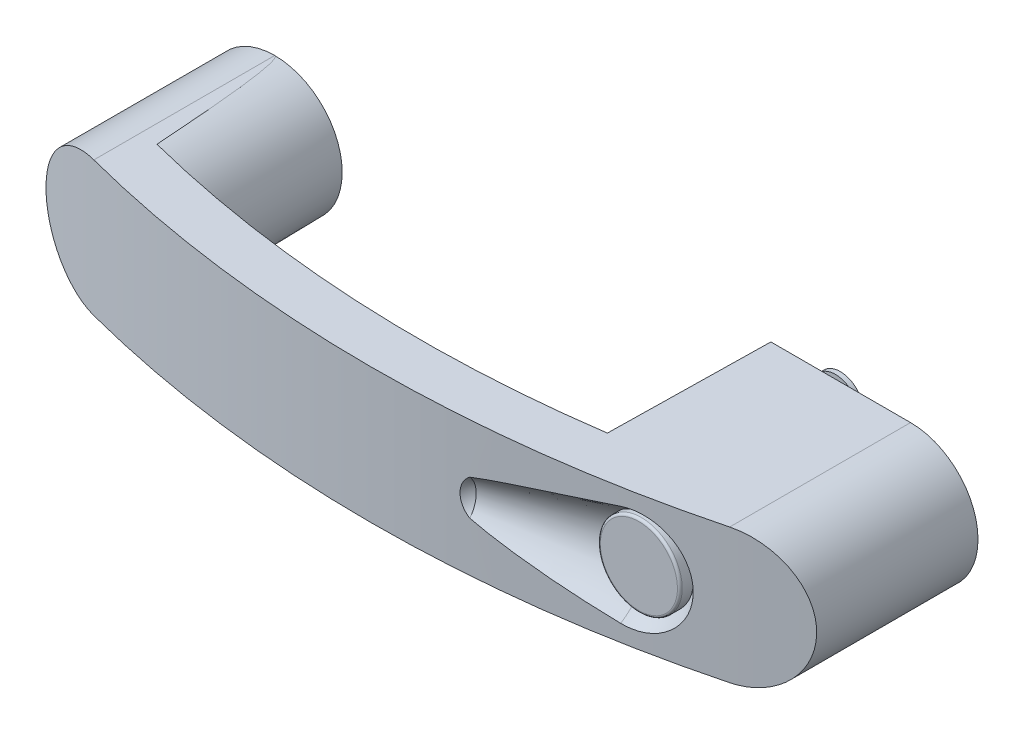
ISO-10303-21;
HEADER;
FILE_DESCRIPTION(('STEP AP214'),'2;1');
FILE_NAME('part.step','',(''),(''),'','','');
FILE_SCHEMA(('AUTOMOTIVE_DESIGN { 1 0 10303 214 1 1 1 1 }'));
ENDSEC;
DATA;
#1=APPLICATION_CONTEXT('core data for automotive mechanical design processes');
#2=APPLICATION_PROTOCOL_DEFINITION('international standard','automotive_design',2000,#1);
#3=PRODUCT_CONTEXT('',#1,'mechanical');
#4=PRODUCT('Part','Part','',(#3));
#5=PRODUCT_RELATED_PRODUCT_CATEGORY('part','',(#4));
#6=PRODUCT_DEFINITION_FORMATION('','',#4);
#7=PRODUCT_DEFINITION_CONTEXT('part definition',#1,'design');
#8=PRODUCT_DEFINITION('design','',#6,#7);
#9=PRODUCT_DEFINITION_SHAPE('','',#8);
#10=(LENGTH_UNIT() NAMED_UNIT(*) SI_UNIT(.MILLI.,.METRE.));
#11=(NAMED_UNIT(*) PLANE_ANGLE_UNIT() SI_UNIT($,.RADIAN.));
#12=(NAMED_UNIT(*) SI_UNIT($,.STERADIAN.) SOLID_ANGLE_UNIT());
#13=UNCERTAINTY_MEASURE_WITH_UNIT(LENGTH_MEASURE(1.E-05),#10,'distance_accuracy_value','');
#14=(GEOMETRIC_REPRESENTATION_CONTEXT(3) GLOBAL_UNCERTAINTY_ASSIGNED_CONTEXT((#13)) GLOBAL_UNIT_ASSIGNED_CONTEXT((#10,
#11,#12)) REPRESENTATION_CONTEXT('',''));
#15=CARTESIAN_POINT('',(0.,0.,0.));
#16=DIRECTION('',(0.,0.,1.));
#17=DIRECTION('',(1.,0.,0.));
#18=AXIS2_PLACEMENT_3D('',#15,#16,#17);
#19=CARTESIAN_POINT('',(132.,0.,0.));
#20=DIRECTION('',(0.,0.,1.));
#21=DIRECTION('',(0.,1.,0.));
#22=AXIS2_PLACEMENT_3D('',#19,#20,#21);
#23=PLANE('',#22);
#24=CARTESIAN_POINT('',(113.4,7.1,0.));
#25=DIRECTION('',(0.,0.,1.));
#26=DIRECTION('',(1.,0.,0.));
#27=AXIS2_PLACEMENT_3D('',#24,#25,#26);
#28=CIRCLE('',#27,4.775);
#29=CARTESIAN_POINT('',(118.175,7.1,0.));
#30=VERTEX_POINT('',#29);
#31=EDGE_CURVE('E115',#30,#30,#28,.F.);
#32=ORIENTED_EDGE('',*,*,#31,.F.);
#33=EDGE_LOOP('',(#32));
#34=FACE_BOUND('',#33,.T.);
#35=CARTESIAN_POINT('',(132.,0.,0.));
#36=DIRECTION('',(0.,0.,1.));
#37=DIRECTION('',(0.,1.,0.));
#38=AXIS2_PLACEMENT_3D('',#35,#36,#37);
#39=CIRCLE('',#38,14.);
#40=CARTESIAN_POINT('',(132.,-14.,0.));
#41=VERTEX_POINT('',#40);
#42=CARTESIAN_POINT('',(132.,14.,0.));
#43=VERTEX_POINT('',#42);
#44=EDGE_CURVE('E450',#41,#43,#39,.T.);
#45=ORIENTED_EDGE('',*,*,#44,.F.);
#46=DIRECTION('',(-1.,0.,0.));
#47=VECTOR('',#46,1.);
#48=CARTESIAN_POINT('',(132.,-14.,0.));
#49=LINE('',#48,#47);
#50=CARTESIAN_POINT('',(103.,-14.,0.));
#51=VERTEX_POINT('',#50);
#52=EDGE_CURVE('E305',#41,#51,#49,.T.);
#53=ORIENTED_EDGE('',*,*,#52,.T.);
#54=DIRECTION('',(0.,-1.,0.));
#55=VECTOR('',#54,1.);
#56=CARTESIAN_POINT('',(103.,14.,0.));
#57=LINE('',#56,#55);
#58=CARTESIAN_POINT('',(103.,14.,0.));
#59=VERTEX_POINT('',#58);
#60=EDGE_CURVE('E453',#59,#51,#57,.T.);
#61=ORIENTED_EDGE('',*,*,#60,.F.);
#62=DIRECTION('',(-1.,0.,0.));
#63=VECTOR('',#62,1.);
#64=CARTESIAN_POINT('',(132.,14.,0.));
#65=LINE('',#64,#63);
#66=EDGE_CURVE('E459',#43,#59,#65,.T.);
#67=ORIENTED_EDGE('',*,*,#66,.F.);
#68=EDGE_LOOP('',(#45,#53,#61,#67));
#69=FACE_BOUND('',#68,.T.);
#70=CARTESIAN_POINT('',(132.,0.,0.));
#71=DIRECTION('',(0.,0.,-1.));
#72=DIRECTION('',(0.,-1.,0.));
#73=AXIS2_PLACEMENT_3D('',#70,#71,#72);
#74=CIRCLE('',#73,3.);
#75=CARTESIAN_POINT('',(132.,-3.,0.));
#76=VERTEX_POINT('',#75);
#77=EDGE_CURVE('E479',#76,#76,#74,.T.);
#78=ORIENTED_EDGE('',*,*,#77,.F.);
#79=EDGE_LOOP('',(#78));
#80=FACE_BOUND('',#79,.T.);
#81=CARTESIAN_POINT('',(113.4,-7.1,0.));
#82=DIRECTION('',(0.,0.,1.));
#83=DIRECTION('',(1.,0.,0.));
#84=AXIS2_PLACEMENT_3D('',#81,#82,#83);
#85=CIRCLE('',#84,3.5);
#86=CARTESIAN_POINT('',(116.9,-7.1,0.));
#87=VERTEX_POINT('',#86);
#88=EDGE_CURVE('E187',#87,#87,#85,.F.);
#89=ORIENTED_EDGE('',*,*,#88,.F.);
#90=EDGE_LOOP('',(#89));
#91=FACE_BOUND('',#90,.T.);
#92=CARTESIAN_POINT('',(119.8,0.,0.));
#93=DIRECTION('',(0.,0.,1.));
#94=DIRECTION('',(1.,0.,0.));
#95=AXIS2_PLACEMENT_3D('',#92,#93,#94);
#96=CIRCLE('',#95,4.775);
#97=CARTESIAN_POINT('',(124.575,0.,0.));
#98=VERTEX_POINT('',#97);
#99=EDGE_CURVE('E204',#98,#98,#96,.F.);
#100=ORIENTED_EDGE('',*,*,#99,.F.);
#101=EDGE_LOOP('',(#100));
#102=FACE_BOUND('',#101,.T.);
#103=ADVANCED_FACE('F14',(#34,#69,#80,#91,#102),#23,.F.);
#104=CARTESIAN_POINT('',(119.8,0.,-4.));
#105=DIRECTION('',(0.,0.,1.));
#106=DIRECTION('',(0.,1.,0.));
#107=AXIS2_PLACEMENT_3D('',#104,#105,#106);
#108=CONICAL_SURFACE('',#107,4.8,1.30899693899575);
#109=CARTESIAN_POINT('',(119.8,0.,-4.5));
#110=DIRECTION('',(0.,0.,-1.));
#111=DIRECTION('',(0.,-1.,0.));
#112=AXIS2_PLACEMENT_3D('',#109,#110,#111);
#113=CIRCLE('',#112,2.93397459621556);
#114=CARTESIAN_POINT('',(119.8,-2.93397459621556,-4.5));
#115=VERTEX_POINT('',#114);
#116=EDGE_CURVE('E336',#115,#115,#113,.T.);
#117=ORIENTED_EDGE('',*,*,#116,.F.);
#118=EDGE_LOOP('',(#117));
#119=FACE_BOUND('',#118,.T.);
#120=CARTESIAN_POINT('',(119.8,0.,-4.00669872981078));
#121=DIRECTION('',(0.,0.,1.));
#122=DIRECTION('',(1.,0.,0.));
#123=AXIS2_PLACEMENT_3D('',#120,#121,#122);
#124=CIRCLE('',#123,4.775);
#125=CARTESIAN_POINT('',(116.815370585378,-3.72727947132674,-4.00669872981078));
#126=VERTEX_POINT('',#125);
#127=CARTESIAN_POINT('',(116.815370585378,3.72727947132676,-4.00669872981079));
#128=VERTEX_POINT('',#127);
#129=EDGE_CURVE('E33',#126,#128,#124,.T.);
#130=ORIENTED_EDGE('',*,*,#129,.F.);
#131=CARTESIAN_POINT('',(116.815370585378,-3.7272794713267,-4.00669872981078));
#132=CARTESIAN_POINT('',(116.798973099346,-3.7106740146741,-4.00742561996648));
#133=CARTESIAN_POINT('',(116.78245650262,-3.69418209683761,-4.00806350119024));
#134=CARTESIAN_POINT('',(116.749251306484,-3.66150010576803,-4.00915641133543));
#135=CARTESIAN_POINT('',(116.732563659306,-3.64530908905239,-4.00961216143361));
#136=CARTESIAN_POINT('',(116.698996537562,-3.613213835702,-4.01034084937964));
#137=CARTESIAN_POINT('',(116.682117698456,-3.59730894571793,-4.01061427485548));
#138=CARTESIAN_POINT('',(116.64814941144,-3.56576984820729,-4.01097860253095));
#139=CARTESIAN_POINT('',(116.63106027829,-3.55013530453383,-4.01106975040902));
#140=CARTESIAN_POINT('',(116.596652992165,-3.51912028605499,-4.01106975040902));
#141=CARTESIAN_POINT('',(116.57933483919,-3.50373981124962,-4.01097860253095));
#142=CARTESIAN_POINT('',(116.54445168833,-3.47321564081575,-4.01061427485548));
#143=CARTESIAN_POINT('',(116.526886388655,-3.45807229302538,-4.01034084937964));
#144=CARTESIAN_POINT('',(116.491491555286,-3.42800465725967,-4.00961216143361));
#145=CARTESIAN_POINT('',(116.473661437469,-3.41308106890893,-4.00915641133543));
#146=CARTESIAN_POINT('',(116.437720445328,-3.38343410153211,-4.00806350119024));
#147=CARTESIAN_POINT('',(116.419608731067,-3.36871176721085,-4.00742561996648));
#148=CARTESIAN_POINT('',(116.401396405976,-3.35411964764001,-4.00669872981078));
#149=B_SPLINE_CURVE_WITH_KNOTS('',3,(#131,#132,#133,#134,#135,#136,#137,#138,#139,#140,#141,
#142,#143,#144,#145,#146,#147,#148),.UNSPECIFIED.,.F.,.F.,(4,2,2,2,2,2,2,2,4),(0.,
0.0700446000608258,0.139809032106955,0.209386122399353,0.27886937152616,0.348352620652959,
0.41792971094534,0.487694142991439,0.557738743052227),.UNSPECIFIED.);
#150=CARTESIAN_POINT('',(116.401396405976,-3.35411964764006,-4.00669872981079));
#151=VERTEX_POINT('',#150);
#152=EDGE_CURVE('E26',#126,#151,#149,.T.);
#153=ORIENTED_EDGE('',*,*,#152,.T.);
#154=CARTESIAN_POINT('',(116.401396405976,3.35411964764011,-4.00669872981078));
#155=VERTEX_POINT('',#154);
#156=EDGE_CURVE('E186',#155,#151,#124,.T.);
#157=ORIENTED_EDGE('',*,*,#156,.F.);
#158=CARTESIAN_POINT('',(116.401396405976,3.35411964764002,-4.00669872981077));
#159=CARTESIAN_POINT('',(116.419608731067,3.36871176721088,-4.00742561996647));
#160=CARTESIAN_POINT('',(116.437720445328,3.38343410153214,-4.00806350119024));
#161=CARTESIAN_POINT('',(116.473661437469,3.41308106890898,-4.00915641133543));
#162=CARTESIAN_POINT('',(116.491491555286,3.42800465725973,-4.00961216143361));
#163=CARTESIAN_POINT('',(116.526886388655,3.45807229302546,-4.01034084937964));
#164=CARTESIAN_POINT('',(116.54445168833,3.47321564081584,-4.01061427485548));
#165=CARTESIAN_POINT('',(116.57933483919,3.50373981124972,-4.01097860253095));
#166=CARTESIAN_POINT('',(116.596652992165,3.5191202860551,-4.01106975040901));
#167=CARTESIAN_POINT('',(116.63106027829,3.55013530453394,-4.01106975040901));
#168=CARTESIAN_POINT('',(116.64814941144,3.5657698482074,-4.01097860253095));
#169=CARTESIAN_POINT('',(116.682117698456,3.59730894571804,-4.01061427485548));
#170=CARTESIAN_POINT('',(116.698996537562,3.61321383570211,-4.01034084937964));
#171=CARTESIAN_POINT('',(116.732563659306,3.6453090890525,-4.00961216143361));
#172=CARTESIAN_POINT('',(116.749251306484,3.66150010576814,-4.00915641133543));
#173=CARTESIAN_POINT('',(116.78245650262,3.69418209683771,-4.00806350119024));
#174=CARTESIAN_POINT('',(116.798973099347,3.7106740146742,-4.00742561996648));
#175=CARTESIAN_POINT('',(116.815370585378,3.72727947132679,-4.00669872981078));
#176=B_SPLINE_CURVE_WITH_KNOTS('',3,(#158,#159,#160,#161,#162,#163,#164,#165,#166,#167,#168,
#169,#170,#171,#172,#173,#174,#175),.UNSPECIFIED.,.F.,.F.,(4,2,2,2,2,2,2,2,4),(0.,
0.0700446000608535,0.139809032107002,0.209386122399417,0.278869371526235,0.348352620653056,
0.417929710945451,0.487694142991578,0.557738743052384),.UNSPECIFIED.);
#177=EDGE_CURVE('E184',#155,#128,#176,.T.);
#178=ORIENTED_EDGE('',*,*,#177,.T.);
#179=EDGE_LOOP('',(#130,#153,#157,#178));
#180=FACE_BOUND('',#179,.T.);
#181=ADVANCED_FACE('F158',(#119,#180),#108,.T.);
#182=CARTESIAN_POINT('',(115.,0.,-1.8));
#183=DIRECTION('',(0.,0.,1.));
#184=DIRECTION('',(0.,1.,0.));
#185=AXIS2_PLACEMENT_3D('',#182,#183,#184);
#186=PLANE('',#185);
#187=CARTESIAN_POINT('',(119.8,0.,-1.8));
#188=DIRECTION('',(0.,0.,-1.));
#189=DIRECTION('',(0.,-1.,0.));
#190=AXIS2_PLACEMENT_3D('',#187,#188,#189);
#191=CIRCLE('',#190,3.36);
#192=CARTESIAN_POINT('',(119.8,-3.36,-1.8));
#193=VERTEX_POINT('',#192);
#194=EDGE_CURVE('E328',#193,#193,#191,.T.);
#195=ORIENTED_EDGE('',*,*,#194,.F.);
#196=EDGE_LOOP('',(#195));
#197=FACE_BOUND('',#196,.T.);
#198=CARTESIAN_POINT('',(119.8,0.,-1.8));
#199=DIRECTION('',(0.,0.,1.));
#200=DIRECTION('',(1.,0.,0.));
#201=AXIS2_PLACEMENT_3D('',#198,#199,#200);
#202=CIRCLE('',#201,4.775);
#203=CARTESIAN_POINT('',(124.575,0.,-1.8));
#204=VERTEX_POINT('',#203);
#205=EDGE_CURVE('E121',#204,#204,#202,.T.);
#206=ORIENTED_EDGE('',*,*,#205,.F.);
#207=EDGE_LOOP('',(#206));
#208=FACE_BOUND('',#207,.T.);
#209=ADVANCED_FACE('F162',(#197,#208),#186,.F.);
#210=CARTESIAN_POINT('',(116.44,0.,-3.));
#211=DIRECTION('',(0.,0.,-1.));
#212=DIRECTION('',(0.,-1.,0.));
#213=AXIS2_PLACEMENT_3D('',#210,#211,#212);
#214=PLANE('',#213);
#215=CARTESIAN_POINT('',(119.8,0.,-3.));
#216=DIRECTION('',(0.,0.,-1.));
#217=DIRECTION('',(0.,-1.,0.));
#218=AXIS2_PLACEMENT_3D('',#215,#216,#217);
#219=CIRCLE('',#218,3.36);
#220=CARTESIAN_POINT('',(119.8,-3.36,-3.));
#221=VERTEX_POINT('',#220);
#222=EDGE_CURVE('E333',#221,#221,#219,.T.);
#223=ORIENTED_EDGE('',*,*,#222,.T.);
#224=EDGE_LOOP('',(#223));
#225=FACE_BOUND('',#224,.T.);
#226=CARTESIAN_POINT('',(119.8,0.,-3.));
#227=DIRECTION('',(0.,0.,-1.));
#228=DIRECTION('',(-1.,0.,0.));
#229=AXIS2_PLACEMENT_3D('',#226,#227,#228);
#230=CIRCLE('',#229,4.775);
#231=CARTESIAN_POINT('',(115.025,0.,-3.));
#232=VERTEX_POINT('',#231);
#233=EDGE_CURVE('E207',#232,#232,#230,.T.);
#234=ORIENTED_EDGE('',*,*,#233,.F.);
#235=EDGE_LOOP('',(#234));
#236=FACE_BOUND('',#235,.T.);
#237=ADVANCED_FACE('F164',(#225,#236),#214,.F.);
#238=CARTESIAN_POINT('',(116.558141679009,0.,46.5412868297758));
#239=DIRECTION('',(-0.996194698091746,0.,0.0871557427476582));
#240=DIRECTION('',(0.0871557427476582,0.,0.996194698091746));
#241=AXIS2_PLACEMENT_3D('',#238,#239,#240);
#242=SPHERICAL_SURFACE('',#241,12.);
#243=CARTESIAN_POINT('',(112.913459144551,-8.06427295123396,38.4367331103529));
#244=CARTESIAN_POINT('',(113.141691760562,-8.14033289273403,38.4097493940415));
#245=CARTESIAN_POINT('',(113.373137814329,-8.20664681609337,38.3825233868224));
#246=CARTESIAN_POINT('',(113.840772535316,-8.31942619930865,38.3277900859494));
#247=CARTESIAN_POINT('',(114.076960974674,-8.3658926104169,38.3002828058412));
#248=CARTESIAN_POINT('',(114.55227365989,-8.43860575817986,38.2452044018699));
#249=CARTESIAN_POINT('',(114.791396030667,-8.46486478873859,38.2176333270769));
#250=CARTESIAN_POINT('',(115.271016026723,-8.49703055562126,38.1626058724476));
#251=CARTESIAN_POINT('',(115.511513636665,-8.50293751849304,38.135149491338));
#252=CARTESIAN_POINT('',(115.992291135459,-8.49434763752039,38.0805272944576));
#253=CARTESIAN_POINT('',(116.232570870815,-8.47984129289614,38.053361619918));
#254=CARTESIAN_POINT('',(116.711092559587,-8.43049985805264,37.9995154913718));
#255=CARTESIAN_POINT('',(116.949334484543,-8.39566448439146,37.9728350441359));
#256=CARTESIAN_POINT('',(117.422025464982,-8.30590658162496,37.9201398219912));
#257=CARTESIAN_POINT('',(117.656475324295,-8.25098836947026,37.8941249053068));
#258=CARTESIAN_POINT('',(118.119954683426,-8.12143626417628,37.8429210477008));
#259=CARTESIAN_POINT('',(118.348984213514,-8.04680248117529,37.8177321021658));
#260=CARTESIAN_POINT('',(118.799679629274,-7.87844158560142,37.7683702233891));
#261=CARTESIAN_POINT('',(119.021354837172,-7.78473980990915,37.7441959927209));
#262=CARTESIAN_POINT('',(119.456137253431,-7.57879197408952,37.6969680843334));
#263=CARTESIAN_POINT('',(119.669241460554,-7.46653948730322,37.673914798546));
#264=CARTESIAN_POINT('',(120.085247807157,-7.22429824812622,37.6290776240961));
#265=CARTESIAN_POINT('',(120.288150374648,-7.09431024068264,37.607293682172));
#266=CARTESIAN_POINT('',(120.682288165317,-6.81750239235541,37.5651232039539));
#267=CARTESIAN_POINT('',(120.873523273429,-6.67068238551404,37.5447366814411));
#268=CARTESIAN_POINT('',(121.242076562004,-6.36195669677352,37.5055708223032));
#269=CARTESIAN_POINT('',(121.419454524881,-6.20012326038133,37.4867845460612));
#270=CARTESIAN_POINT('',(121.75997133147,-5.86193942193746,37.4508226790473));
#271=CARTESIAN_POINT('',(121.923109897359,-5.68558873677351,37.4336471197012));
#272=CARTESIAN_POINT('',(122.23390643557,-5.31967035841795,37.4010091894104));
#273=CARTESIAN_POINT('',(122.381568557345,-5.13010623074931,37.3855463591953));
#274=CARTESIAN_POINT('',(122.660424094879,-4.73899906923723,37.3564106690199));
#275=CARTESIAN_POINT('',(122.791611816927,-4.53745192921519,37.3427384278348));
#276=CARTESIAN_POINT('',(123.035791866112,-4.12505713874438,37.3173392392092));
#277=CARTESIAN_POINT('',(123.148883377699,-3.91426886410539,37.3056016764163));
#278=CARTESIAN_POINT('',(123.35693707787,-3.48382955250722,37.2840426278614));
#279=CARTESIAN_POINT('',(123.451899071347,-3.26417842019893,37.2742211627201));
#280=CARTESIAN_POINT('',(123.622990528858,-2.81758778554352,37.2565484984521));
#281=CARTESIAN_POINT('',(123.699120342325,-2.59064841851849,37.2486972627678));
#282=CARTESIAN_POINT('',(123.83198848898,-2.13109748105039,37.2350075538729));
#283=CARTESIAN_POINT('',(123.888726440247,-1.89848579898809,37.2291691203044));
#284=CARTESIAN_POINT('',(123.98217070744,-1.43035627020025,37.2195594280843));
#285=CARTESIAN_POINT('',(124.01896886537,-1.19485694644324,37.21577869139));
#286=CARTESIAN_POINT('',(124.072673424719,-0.721499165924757,37.2102624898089));
#287=CARTESIAN_POINT('',(124.089573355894,-0.483639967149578,37.2085276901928));
#288=CARTESIAN_POINT('',(124.103333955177,-0.00738052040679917,37.2071150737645));
#289=CARTESIAN_POINT('',(124.100198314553,0.23101961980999,37.2074368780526));
#290=CARTESIAN_POINT('',(124.073919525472,0.706702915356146,37.2101348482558));
#291=CARTESIAN_POINT('',(124.050776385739,0.943986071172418,37.2125110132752));
#292=CARTESIAN_POINT('',(123.984711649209,1.41532374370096,37.2192988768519));
#293=CARTESIAN_POINT('',(123.941825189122,1.64938323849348,37.2237069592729));
#294=CARTESIAN_POINT('',(123.836616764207,2.11296475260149,37.2345320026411));
#295=CARTESIAN_POINT('',(123.774301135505,2.34248822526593,37.2409483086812));
#296=CARTESIAN_POINT('',(123.63067264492,2.79549044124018,37.2557570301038));
#297=CARTESIAN_POINT('',(123.54935647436,3.01896812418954,37.2641497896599));
#298=CARTESIAN_POINT('',(123.368327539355,3.45825421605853,37.2828653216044));
#299=CARTESIAN_POINT('',(123.268615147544,3.67406278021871,37.2931880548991));
#300=CARTESIAN_POINT('',(123.05138803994,4.09674822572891,37.3157211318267));
#301=CARTESIAN_POINT('',(122.933852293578,4.3036141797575,37.3279337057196));
#302=CARTESIAN_POINT('',(122.681920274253,4.70668555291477,37.3541707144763));
#303=CARTESIAN_POINT('',(122.547524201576,4.90289109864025,37.368195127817));
#304=CARTESIAN_POINT('',(122.262813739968,5.2833104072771,37.3979818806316));
#305=CARTESIAN_POINT('',(122.112496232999,5.46752180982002,37.4137445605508));
#306=CARTESIAN_POINT('',(121.797100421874,5.82256910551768,37.4469127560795));
#307=CARTESIAN_POINT('',(121.632027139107,5.9934095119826,37.4643177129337));
#308=CARTESIAN_POINT('',(121.28754594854,6.32128121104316,37.500753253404));
#309=CARTESIAN_POINT('',(121.108081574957,6.47825246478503,37.5197902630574));
#310=CARTESIAN_POINT('',(120.736709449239,6.77649853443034,37.5593190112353));
#311=CARTESIAN_POINT('',(120.544801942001,6.91777365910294,37.5798107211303));
#312=CARTESIAN_POINT('',(120.149918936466,7.18365447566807,37.6221306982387));
#313=CARTESIAN_POINT('',(119.946943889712,7.30826084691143,37.6439589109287));
#314=CARTESIAN_POINT('',(119.531363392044,7.53995886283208,37.6888253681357));
#315=CARTESIAN_POINT('',(119.31875803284,7.64705067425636,37.7118636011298));
#316=CARTESIAN_POINT('',(118.884244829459,7.8435255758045,37.7591418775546));
#317=CARTESIAN_POINT('',(118.662292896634,7.93280976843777,37.783387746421));
#318=CARTESIAN_POINT('',(118.211826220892,8.09230714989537,37.8328096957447));
#319=CARTESIAN_POINT('',(117.983313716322,8.16252675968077,37.8579854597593));
#320=CARTESIAN_POINT('',(117.521122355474,8.28350103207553,37.9091356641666));
#321=CARTESIAN_POINT('',(117.287440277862,8.33424317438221,37.9351106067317));
#322=CARTESIAN_POINT('',(116.816709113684,8.41585880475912,37.9876785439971));
#323=CARTESIAN_POINT('',(116.579660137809,8.44673294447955,38.0142715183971));
#324=CARTESIAN_POINT('',(116.10247672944,8.48853416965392,38.0680595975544));
#325=CARTESIAN_POINT('',(115.862332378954,8.49934472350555,38.0952572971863));
#326=CARTESIAN_POINT('',(115.382024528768,8.50059740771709,38.1499217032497));
#327=CARTESIAN_POINT('',(115.141861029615,8.49103999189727,38.1773884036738));
#328=CARTESIAN_POINT('',(114.663613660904,8.45166638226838,38.2323556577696));
#329=CARTESIAN_POINT('',(114.425527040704,8.42188321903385,38.2598560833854));
#330=CARTESIAN_POINT('',(113.952809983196,8.34231130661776,38.314730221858));
#331=CARTESIAN_POINT('',(113.718177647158,8.29253400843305,38.3421039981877));
#332=CARTESIAN_POINT('',(113.389661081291,8.2081867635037,38.3806215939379));
#333=CARTESIAN_POINT('',(113.293651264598,8.18172819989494,38.3919019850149));
#334=CARTESIAN_POINT('',(113.102736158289,8.12548818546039,38.4143793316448));
#335=CARTESIAN_POINT('',(113.007829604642,8.09571106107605,38.4255763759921));
#336=CARTESIAN_POINT('',(112.913459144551,8.06427295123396,38.4367331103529));
#337=B_SPLINE_CURVE_WITH_KNOTS('',3,(#243,#244,#245,#246,#247,#248,#249,#250,#251,#252,#253,
#254,#255,#256,#257,#258,#259,#260,#261,#262,#263,#264,#265,#266,#267,#268,#269,#270,#271,#272,
#273,#274,#275,#276,#277,#278,#279,#280,#281,#282,#283,#284,#285,#286,#287,#288,#289,#290,#291,
#292,#293,#294,#295,#296,#297,#298,#299,#300,#301,#302,#303,#304,#305,#306,#307,#308,#309,#310,
#311,#312,#313,#314,#315,#316,#317,#318,#319,#320,#321,#322,#323,#324,#325,#326,#327,#328,#329,
#330,#331,#332,#333,#334,#335,#336),.UNSPECIFIED.,.F.,.F.,(4,2,2,2,2,2,2,2,2,2,2,2,2,2,2,2,2,2,
2,2,2,2,2,2,2,2,2,2,2,2,2,2,2,2,2,2,2,2,2,2,2,2,2,2,2,2,4),(0.,0.726021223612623,
1.45200764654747,2.17755203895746,2.90308835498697,3.62896246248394,4.35484669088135,
5.08057497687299,5.80629920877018,6.53106534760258,7.25608310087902,7.98107041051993,
8.70606486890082,9.42773561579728,10.149420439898,10.870911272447,11.5926507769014,
12.3102879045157,13.0279327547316,13.7455642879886,14.4632099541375,15.1775214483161,
15.8920651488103,16.6064772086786,17.3208889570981,18.0340341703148,18.7469470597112,
19.4599841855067,20.1730068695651,20.8868775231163,21.6007396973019,22.3147419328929,
23.0285021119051,23.7452144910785,24.4619127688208,25.17858182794,25.895244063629,
26.6157818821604,27.3360767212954,28.0568338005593,28.7775672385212,29.5024738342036,
30.2273642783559,30.9510737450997,31.6743693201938,31.9749970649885,32.2752373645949),.UNSPECIFIED.);
#338=CARTESIAN_POINT('',(113.201899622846,-8.15469892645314,38.4027043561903));
#339=VERTEX_POINT('',#338);
#340=CARTESIAN_POINT('',(113.201899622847,8.15469892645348,38.4027043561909));
#341=VERTEX_POINT('',#340);
#342=EDGE_CURVE('E355',#339,#341,#337,.T.);
#343=ORIENTED_EDGE('',*,*,#342,.F.);
#344=CARTESIAN_POINT('',(113.934019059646,0.,46.770867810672));
#345=DIRECTION('',(-0.996194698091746,0.,0.0871557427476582));
#346=DIRECTION('',(0.0871557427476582,0.,0.996194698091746));
#347=AXIS2_PLACEMENT_3D('',#344,#345,#346);
#348=CIRCLE('',#347,11.7073170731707);
#349=CARTESIAN_POINT('',(113.486929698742,-10.5236248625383,41.6606130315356));
#350=VERTEX_POINT('',#349);
#351=EDGE_CURVE('E351',#339,#350,#348,.T.);
#352=ORIENTED_EDGE('',*,*,#351,.T.);
#353=CARTESIAN_POINT('',(112.913459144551,10.387951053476,41.7656442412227));
#354=CARTESIAN_POINT('',(113.195016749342,10.4632138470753,41.7144055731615));
#355=CARTESIAN_POINT('',(113.479619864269,10.5263593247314,41.6621263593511));
#356=CARTESIAN_POINT('',(114.052851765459,10.6280835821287,41.5558341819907));
#357=CARTESIAN_POINT('',(114.34148038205,10.6666633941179,41.5018212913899));
#358=CARTESIAN_POINT('',(114.92048282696,10.7189090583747,41.3924499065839));
#359=CARTESIAN_POINT('',(115.210855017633,10.7325954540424,41.3370925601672));
#360=CARTESIAN_POINT('',(115.791505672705,10.7350241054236,41.2253745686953));
#361=CARTESIAN_POINT('',(116.081784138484,10.723766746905,41.1690139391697));
#362=CARTESIAN_POINT('',(116.660330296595,10.6763791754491,41.055670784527));
#363=CARTESIAN_POINT('',(116.948596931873,10.6402367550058,40.9986879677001));
#364=CARTESIAN_POINT('',(117.520935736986,10.5433387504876,40.8845622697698));
#365=CARTESIAN_POINT('',(117.805007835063,10.4825827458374,40.8274193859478));
#366=CARTESIAN_POINT('',(118.36689395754,10.3369283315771,40.7134406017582));
#367=CARTESIAN_POINT('',(118.644709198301,10.2520346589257,40.6566046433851));
#368=CARTESIAN_POINT('',(119.192193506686,10.0587352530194,40.5436974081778));
#369=CARTESIAN_POINT('',(119.461862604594,9.95032960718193,40.4876261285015));
#370=CARTESIAN_POINT('',(119.991387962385,9.71071928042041,40.3766823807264));
#371=CARTESIAN_POINT('',(120.251236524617,9.5794971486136,40.3218108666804));
#372=CARTESIAN_POINT('',(120.75922104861,9.29522002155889,40.2137685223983));
#373=CARTESIAN_POINT('',(121.007352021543,9.14215583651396,40.1605984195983));
#374=CARTESIAN_POINT('',(121.490136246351,8.81532908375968,40.0564503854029));
#375=CARTESIAN_POINT('',(121.724787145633,8.64156291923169,40.0054728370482));
#376=CARTESIAN_POINT('',(122.178890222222,8.2746914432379,39.9062060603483));
#377=CARTESIAN_POINT('',(122.398348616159,8.08159412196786,39.8579157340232));
#378=CARTESIAN_POINT('',(122.822337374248,7.67583398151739,39.7640895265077));
#379=CARTESIAN_POINT('',(123.026740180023,7.46303231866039,39.7185776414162));
#380=CARTESIAN_POINT('',(123.417376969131,7.02067539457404,39.6311500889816));
#381=CARTESIAN_POINT('',(123.603610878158,6.7911200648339,39.5892344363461));
#382=CARTESIAN_POINT('',(123.956677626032,6.31690466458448,39.5094054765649));
#383=CARTESIAN_POINT('',(124.123511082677,6.07224507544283,39.4714920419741));
#384=CARTESIAN_POINT('',(124.436700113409,5.56954377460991,39.4000350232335));
#385=CARTESIAN_POINT('',(124.583055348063,5.31150184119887,39.3664915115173));
#386=CARTESIAN_POINT('',(124.855709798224,4.78119021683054,39.3037900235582));
#387=CARTESIAN_POINT('',(124.981792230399,4.50880342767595,39.2746796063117));
#388=CARTESIAN_POINT('',(125.211280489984,3.95415999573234,39.2215471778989));
#389=CARTESIAN_POINT('',(125.314686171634,3.67190328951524,39.1975251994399));
#390=CARTESIAN_POINT('',(125.498159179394,3.09949381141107,39.1548117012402));
#391=CARTESIAN_POINT('',(125.578225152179,2.80934058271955,39.1361204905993));
#392=CARTESIAN_POINT('',(125.714498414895,2.22318658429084,39.104260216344));
#393=CARTESIAN_POINT('',(125.770705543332,1.92718577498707,39.091091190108));
#394=CARTESIAN_POINT('',(125.859264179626,1.32895864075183,39.0703247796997));
#395=CARTESIAN_POINT('',(125.891416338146,1.02670117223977,39.062773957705));
#396=CARTESIAN_POINT('',(125.930896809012,0.420479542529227,39.0535003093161));
#397=CARTESIAN_POINT('',(125.9382249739,0.116515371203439,39.0517775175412));
#398=CARTESIAN_POINT('',(125.928009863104,-0.490982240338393,39.05417789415));
#399=CARTESIAN_POINT('',(125.910465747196,-0.794515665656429,39.0583012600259));
#400=CARTESIAN_POINT('',(125.850618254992,-1.39898989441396,39.0723513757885));
#401=CARTESIAN_POINT('',(125.808315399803,-1.69993075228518,39.0822780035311));
#402=CARTESIAN_POINT('',(125.699054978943,-2.29802063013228,39.1078712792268));
#403=CARTESIAN_POINT('',(125.632021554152,-2.59515504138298,39.1235555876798));
#404=CARTESIAN_POINT('',(125.473754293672,-3.18255464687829,39.1604968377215));
#405=CARTESIAN_POINT('',(125.382520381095,-3.47281981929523,39.1817537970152));
#406=CARTESIAN_POINT('',(125.176453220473,-4.04438916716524,39.2296192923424));
#407=CARTESIAN_POINT('',(125.061620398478,-4.32569350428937,39.2562277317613));
#408=CARTESIAN_POINT('',(124.809114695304,-4.87731112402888,39.314521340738));
#409=CARTESIAN_POINT('',(124.671441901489,-5.14762444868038,39.3462064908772));
#410=CARTESIAN_POINT('',(124.374664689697,-5.6744230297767,39.4142157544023));
#411=CARTESIAN_POINT('',(124.21563215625,-5.93095079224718,39.4505242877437));
#412=CARTESIAN_POINT('',(123.876857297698,-6.4292568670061,39.5274927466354));
#413=CARTESIAN_POINT('',(123.69711498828,-6.67103519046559,39.5681526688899));
#414=CARTESIAN_POINT('',(123.318136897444,-7.13806335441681,39.6534155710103));
#415=CARTESIAN_POINT('',(123.118900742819,-7.36331287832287,39.6980186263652));
#416=CARTESIAN_POINT('',(122.702307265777,-7.79559918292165,39.7907228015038));
#417=CARTESIAN_POINT('',(122.484950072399,-8.00263609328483,39.8388238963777));
#418=CARTESIAN_POINT('',(122.035526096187,-8.39528040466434,39.9376335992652));
#419=CARTESIAN_POINT('',(121.803598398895,-8.58105338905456,39.9883168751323));
#420=CARTESIAN_POINT('',(121.325015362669,-8.93177435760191,40.0921760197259));
#421=CARTESIAN_POINT('',(121.078359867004,-9.09672212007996,40.1453519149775));
#422=CARTESIAN_POINT('',(120.572086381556,-9.40452440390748,40.2536914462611));
#423=CARTESIAN_POINT('',(120.312470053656,-9.54738174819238,40.3088548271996));
#424=CARTESIAN_POINT('',(119.78208955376,-9.8099387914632,40.4206705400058));
#425=CARTESIAN_POINT('',(119.511325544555,-9.92963882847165,40.4773228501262));
#426=CARTESIAN_POINT('',(118.963344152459,-10.1438869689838,40.5910397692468));
#427=CARTESIAN_POINT('',(118.686218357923,-10.2386745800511,40.6480945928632));
#428=CARTESIAN_POINT('',(118.124912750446,-10.403933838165,40.7626832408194));
#429=CARTESIAN_POINT('',(117.840733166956,-10.4744062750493,40.8202170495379));
#430=CARTESIAN_POINT('',(117.267366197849,-10.5904983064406,40.9352888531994));
#431=CARTESIAN_POINT('',(116.978179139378,-10.6361195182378,40.9928268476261));
#432=CARTESIAN_POINT('',(116.396875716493,-10.702162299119,41.1074534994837));
#433=CARTESIAN_POINT('',(116.104759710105,-10.7225869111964,41.1645422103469));
#434=CARTESIAN_POINT('',(115.568500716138,-10.7368008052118,41.2683918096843));
#435=CARTESIAN_POINT('',(115.324478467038,-10.7344627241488,41.3152878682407));
#436=CARTESIAN_POINT('',(114.837096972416,-10.712209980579,41.4082351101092));
#437=CARTESIAN_POINT('',(114.593737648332,-10.6922975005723,41.4542863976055));
#438=CARTESIAN_POINT('',(114.109016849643,-10.6350135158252,41.5453031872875));
#439=CARTESIAN_POINT('',(113.867654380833,-10.5976513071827,41.5902692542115));
#440=CARTESIAN_POINT('',(113.387967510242,-10.5056822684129,41.6789482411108));
#441=CARTESIAN_POINT('',(113.149643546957,-10.45107297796,41.7226609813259));
#442=CARTESIAN_POINT('',(112.913459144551,-10.387951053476,41.7656442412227));
#443=B_SPLINE_CURVE_WITH_KNOTS('',3,(#353,#354,#355,#356,#357,#358,#359,#360,#361,#362,#363,
#364,#365,#366,#367,#368,#369,#370,#371,#372,#373,#374,#375,#376,#377,#378,#379,#380,#381,#382,
#383,#384,#385,#386,#387,#388,#389,#390,#391,#392,#393,#394,#395,#396,#397,#398,#399,#400,#401,
#402,#403,#404,#405,#406,#407,#408,#409,#410,#411,#412,#413,#414,#415,#416,#417,#418,#419,#420,
#421,#422,#423,#424,#425,#426,#427,#428,#429,#430,#431,#432,#433,#434,#435,#436,#437,#438,#439,
#440,#441,#442),.UNSPECIFIED.,.F.,.F.,(4,2,2,2,2,2,2,2,2,2,2,2,2,2,2,2,2,2,2,2,2,2,2,2,2,2,2,2,
2,2,2,2,2,2,2,2,2,2,2,2,2,2,2,2,4),(0.,0.887471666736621,1.77490603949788,2.66160772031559,
3.54829568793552,4.43541893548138,5.32255734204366,6.20952176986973,7.09648290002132,
7.98412541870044,8.87214251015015,9.7603141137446,10.6481201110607,11.5427428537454,
12.4373692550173,13.3319671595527,14.2265798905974,15.1302005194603,16.033826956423,
16.9375057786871,17.8411907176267,18.7522841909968,19.6633830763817,20.5745127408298,
21.4856232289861,22.3995520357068,23.3134837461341,24.2273989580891,25.1413106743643,
26.0522203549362,26.9631293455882,27.8740557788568,28.7849757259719,29.6882346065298,
30.5915031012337,31.4946560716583,32.3977958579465,33.2919059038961,34.1859869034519,
35.0800097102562,35.973924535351,36.718819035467,37.4636210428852,38.2080267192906,
38.9525386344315),.UNSPECIFIED.);
#444=CARTESIAN_POINT('',(113.486929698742,10.5236248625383,41.6606130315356));
#445=VERTEX_POINT('',#444);
#446=EDGE_CURVE('E386',#445,#350,#443,.T.);
#447=ORIENTED_EDGE('',*,*,#446,.F.);
#448=EDGE_CURVE('E348',#445,#341,#348,.T.);
#449=ORIENTED_EDGE('',*,*,#448,.T.);
#450=EDGE_LOOP('',(#343,#352,#447,#449));
#451=FACE_BOUND('',#450,.T.);
#452=ADVANCED_FACE('F227',(#451),#242,.F.);
#453=CARTESIAN_POINT('',(113.934019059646,0.,46.770867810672));
#454=DIRECTION('',(0.996194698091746,0.,-0.0871557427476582));
#455=DIRECTION('',(-0.0871557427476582,0.,-0.996194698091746));
#456=AXIS2_PLACEMENT_3D('',#453,#454,#455);
#457=CONICAL_SURFACE('',#456,11.7073170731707,0.221314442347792);
#458=ORIENTED_EDGE('',*,*,#351,.F.);
#459=CARTESIAN_POINT('',(113.487129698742,-8.23321195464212,38.3638811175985));
#460=CARTESIAN_POINT('',(113.391516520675,-8.20867682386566,38.3786560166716));
#461=CARTESIAN_POINT('',(113.296086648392,-8.18240913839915,38.3916283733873));
#462=CARTESIAN_POINT('',(113.105827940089,-8.1264343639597,38.4140021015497));
#463=CARTESIAN_POINT('',(113.010999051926,-8.09672757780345,38.4234037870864));
#464=CARTESIAN_POINT('',(112.728065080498,-8.00258827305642,38.446281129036));
#465=CARTESIAN_POINT('',(112.541182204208,-7.93305221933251,38.4544796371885));
#466=CARTESIAN_POINT('',(112.174745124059,-7.78180716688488,38.4577324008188));
#467=CARTESIAN_POINT('',(111.995133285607,-7.70023892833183,38.4529287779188));
#468=CARTESIAN_POINT('',(111.642505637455,-7.52509177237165,38.4320295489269));
#469=CARTESIAN_POINT('',(111.469491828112,-7.43150924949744,38.4159305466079));
#470=CARTESIAN_POINT('',(111.132144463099,-7.23369250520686,38.3744198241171));
#471=CARTESIAN_POINT('',(110.967768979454,-7.12951870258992,38.3490590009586));
#472=CARTESIAN_POINT('',(110.647446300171,-6.91084816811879,38.2909584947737));
#473=CARTESIAN_POINT('',(110.491498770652,-6.7963518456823,38.258219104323));
#474=CARTESIAN_POINT('',(110.188086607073,-6.55733216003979,38.1871481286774));
#475=CARTESIAN_POINT('',(110.040648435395,-6.43278013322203,38.1488002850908));
#476=CARTESIAN_POINT('',(109.755117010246,-6.17449690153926,38.0683596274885));
#477=CARTESIAN_POINT('',(109.617025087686,-6.04076439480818,38.0262662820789));
#478=CARTESIAN_POINT('',(109.331480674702,-5.74488958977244,37.9337954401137));
#479=CARTESIAN_POINT('',(109.185508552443,-5.58141778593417,37.8830934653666));
#480=CARTESIAN_POINT('',(108.90668879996,-5.24380783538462,37.7811007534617));
#481=CARTESIAN_POINT('',(108.773841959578,-5.06966904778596,37.729809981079));
#482=CARTESIAN_POINT('',(108.521824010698,-4.71140937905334,37.6285828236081));
#483=CARTESIAN_POINT('',(108.402651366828,-4.52728962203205,37.5786462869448));
#484=CARTESIAN_POINT('',(108.178584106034,-4.14979074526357,37.4818558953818));
#485=CARTESIAN_POINT('',(108.073688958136,-3.95641197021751,37.435001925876));
#486=CARTESIAN_POINT('',(107.86769941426,-3.53861319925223,37.3408244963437));
#487=CARTESIAN_POINT('',(107.768410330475,-3.31317181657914,37.2940596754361));
#488=CARTESIAN_POINT('',(107.589378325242,-2.85321608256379,37.2081489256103));
#489=CARTESIAN_POINT('',(107.509636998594,-2.61870099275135,37.1690036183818));
#490=CARTESIAN_POINT('',(107.370704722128,-2.14247046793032,37.099922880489));
#491=CARTESIAN_POINT('',(107.311501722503,-1.90075934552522,37.0699820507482));
#492=CARTESIAN_POINT('',(107.21440907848,-1.4120565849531,37.020499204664));
#493=CARTESIAN_POINT('',(107.176516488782,-1.16506568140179,37.0009557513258));
#494=CARTESIAN_POINT('',(107.125264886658,-0.692569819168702,36.974437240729));
#495=CARTESIAN_POINT('',(107.109857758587,-0.467343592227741,36.9664142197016));
#496=CARTESIAN_POINT('',(107.097021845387,-0.0162463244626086,36.9597334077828));
#497=CARTESIAN_POINT('',(107.099591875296,0.209624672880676,36.9610749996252));
#498=CARTESIAN_POINT('',(107.122672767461,0.660146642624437,36.9730766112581));
#499=CARTESIAN_POINT('',(107.143179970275,0.884797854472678,36.9837347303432));
#500=CARTESIAN_POINT('',(107.201864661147,1.3311623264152,37.0140067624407));
#501=CARTESIAN_POINT('',(107.240041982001,1.55287561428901,37.0336205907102));
#502=CARTESIAN_POINT('',(107.331012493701,1.97959137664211,37.0798330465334));
#503=CARTESIAN_POINT('',(107.382881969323,2.18484047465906,37.1059860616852));
#504=CARTESIAN_POINT('',(107.501457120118,2.59001125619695,37.1649277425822));
#505=CARTESIAN_POINT('',(107.568162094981,2.78993319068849,37.1977160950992));
#506=CARTESIAN_POINT('',(107.715842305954,3.18343136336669,37.2689854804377));
#507=CARTESIAN_POINT('',(107.79682092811,3.37700608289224,37.3074678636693));
#508=CARTESIAN_POINT('',(107.97243107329,3.75685796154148,37.3890048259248));
#509=CARTESIAN_POINT('',(108.067063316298,3.94313473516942,37.4320596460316));
#510=CARTESIAN_POINT('',(108.277361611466,4.32198226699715,37.5250017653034));
#511=CARTESIAN_POINT('',(108.394097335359,4.51389299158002,37.5751601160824));
#512=CARTESIAN_POINT('',(108.642093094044,4.88751639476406,37.6775512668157));
#513=CARTESIAN_POINT('',(108.773354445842,5.06922814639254,37.729784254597));
#514=CARTESIAN_POINT('',(109.049922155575,5.42187623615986,37.8343717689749));
#515=CARTESIAN_POINT('',(109.195241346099,5.59280248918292,37.8867263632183));
#516=CARTESIAN_POINT('',(109.499285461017,5.92297539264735,37.9892545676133));
#517=CARTESIAN_POINT('',(109.658008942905,6.08222329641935,38.0394284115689));
#518=CARTESIAN_POINT('',(109.971764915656,6.37291131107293,38.1302575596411));
#519=CARTESIAN_POINT('',(110.125567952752,6.50553806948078,38.1713627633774));
#520=CARTESIAN_POINT('',(110.443169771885,6.76006641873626,38.2476987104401));
#521=CARTESIAN_POINT('',(110.606966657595,6.88197003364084,38.2829305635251));
#522=CARTESIAN_POINT('',(110.943414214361,7.11391690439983,38.3452054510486));
#523=CARTESIAN_POINT('',(111.116032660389,7.22399932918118,38.3722761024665));
#524=CARTESIAN_POINT('',(111.469750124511,7.43189579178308,38.4161166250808));
#525=CARTESIAN_POINT('',(111.65084627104,7.52971394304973,38.4328899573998));
#526=CARTESIAN_POINT('',(111.967138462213,7.68595348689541,38.4509790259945));
#527=CARTESIAN_POINT('',(112.10056929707,7.74761825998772,38.45535167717));
#528=CARTESIAN_POINT('',(112.370472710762,7.86395194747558,38.4571452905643));
#529=CARTESIAN_POINT('',(112.506944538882,7.91862256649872,38.4545679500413));
#530=CARTESIAN_POINT('',(112.783130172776,8.02103814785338,38.4419152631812));
#531=CARTESIAN_POINT('',(112.92285920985,8.06873617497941,38.4317916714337));
#532=CARTESIAN_POINT('',(113.203975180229,8.15664489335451,38.403747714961));
#533=CARTESIAN_POINT('',(113.345363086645,8.19685092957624,38.3858225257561));
#534=CARTESIAN_POINT('',(113.487129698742,8.23321195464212,38.3638811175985));
#535=B_SPLINE_CURVE_WITH_KNOTS('',3,(#459,#460,#461,#462,#463,#464,#465,#466,#467,#468,#469,
#470,#471,#472,#473,#474,#475,#476,#477,#478,#479,#480,#481,#482,#483,#484,#485,#486,#487,#488,
#489,#490,#491,#492,#493,#494,#495,#496,#497,#498,#499,#500,#501,#502,#503,#504,#505,#506,#507,
#508,#509,#510,#511,#512,#513,#514,#515,#516,#517,#518,#519,#520,#521,#522,#523,#524,#525,#526,
#527,#528,#529,#530,#531,#532,#533,#534),.UNSPECIFIED.,.F.,.F.,(4,2,2,2,2,2,2,2,2,2,2,2,2,2,2,2,
2,2,2,2,2,2,2,2,2,2,2,2,2,2,2,2,2,2,2,2,2,4),(0.,0.299367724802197,0.598709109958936,
1.19636197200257,1.78750856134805,2.37883296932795,2.96695556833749,3.55505485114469,
4.14489407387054,4.73481711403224,5.40900290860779,6.08322924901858,6.75737981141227,
7.43150529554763,8.18269508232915,8.93394613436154,9.68475568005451,10.4354614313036,
11.1122577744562,11.789009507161,12.4656232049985,13.1422305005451,13.7814678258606,
14.4206749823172,15.0600339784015,15.6994267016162,16.3891848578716,17.0790056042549,
17.7694620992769,18.4598443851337,19.08091054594,19.7018592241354,20.3206824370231,
20.9392975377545,21.380137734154,21.8208702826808,22.2644449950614,22.7082944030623),.UNSPECIFIED.);
#536=EDGE_CURVE('E379',#339,#341,#535,.T.);
#537=ORIENTED_EDGE('',*,*,#536,.T.);
#538=ORIENTED_EDGE('',*,*,#448,.F.);
#539=CARTESIAN_POINT('',(114.95457897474,10.8244889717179,41.3857983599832));
#540=CARTESIAN_POINT('',(114.160217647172,10.6627217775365,41.5368855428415));
#541=CARTESIAN_POINT('',(113.365513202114,10.4991408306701,41.6842269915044));
#542=CARTESIAN_POINT('',(111.775512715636,10.1683125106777,41.9714229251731));
#543=CARTESIAN_POINT('',(110.980216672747,10.0010651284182,42.1112773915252));
#544=CARTESIAN_POINT('',(109.389092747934,9.66285756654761,42.3835097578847));
#545=CARTESIAN_POINT('',(108.593264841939,9.49189720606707,42.5158872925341));
#546=CARTESIAN_POINT('',(107.001235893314,9.14613073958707,42.7731609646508));
#547=CARTESIAN_POINT('',(106.205034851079,8.97132463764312,42.898057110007));
#548=CARTESIAN_POINT('',(104.614081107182,8.617991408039,43.1401142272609));
#549=CARTESIAN_POINT('',(103.819328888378,8.43947289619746,43.2572909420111));
#550=CARTESIAN_POINT('',(102.229778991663,8.07796158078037,43.4841953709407));
#551=CARTESIAN_POINT('',(101.434981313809,7.89496878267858,43.5939230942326));
#552=CARTESIAN_POINT('',(99.8455667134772,7.52390071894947,43.8059283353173));
#553=CARTESIAN_POINT('',(99.0509497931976,7.33582539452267,43.9082057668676));
#554=CARTESIAN_POINT('',(97.4622399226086,6.95367733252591,44.1053020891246));
#555=CARTESIAN_POINT('',(96.6681469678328,6.75960464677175,44.2001210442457));
#556=CARTESIAN_POINT('',(95.0154701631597,6.34779581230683,44.3898041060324));
#557=CARTESIAN_POINT('',(94.1569689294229,6.12942812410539,44.4840269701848));
#558=CARTESIAN_POINT('',(92.8708209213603,5.79333589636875,44.6187729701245));
#559=CARTESIAN_POINT('',(92.4423982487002,5.67988886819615,44.6625877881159));
#560=CARTESIAN_POINT('',(91.5862331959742,5.4496153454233,44.7480196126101));
#561=CARTESIAN_POINT('',(91.1584908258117,5.33278880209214,44.7896365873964));
#562=CARTESIAN_POINT('',(90.3034049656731,5.09495208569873,44.8707135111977));
#563=CARTESIAN_POINT('',(89.8760625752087,4.97393704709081,44.9101708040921));
#564=CARTESIAN_POINT('',(89.0226204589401,4.72695934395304,44.9868626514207));
#565=CARTESIAN_POINT('',(88.5965206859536,4.60099686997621,45.0240972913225));
#566=CARTESIAN_POINT('',(87.9585674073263,4.40736030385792,45.078277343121));
#567=CARTESIAN_POINT('',(87.7460759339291,4.34201993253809,45.0960618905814));
#568=CARTESIAN_POINT('',(87.3216011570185,4.20956631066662,45.1310679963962));
#569=CARTESIAN_POINT('',(87.1096178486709,4.14245307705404,45.1482895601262));
#570=CARTESIAN_POINT('',(86.6862278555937,4.00619738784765,45.1821683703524));
#571=CARTESIAN_POINT('',(86.4748212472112,3.93705467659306,45.1988255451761));
#572=CARTESIAN_POINT('',(86.05274097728,3.79641527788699,45.2315685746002));
#573=CARTESIAN_POINT('',(85.8420673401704,3.7249185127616,45.2476544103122));
#574=CARTESIAN_POINT('',(85.6318318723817,3.65208055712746,45.2634516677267));
#575=B_SPLINE_CURVE_WITH_KNOTS('',3,(#539,#540,#541,#542,#543,#544,#545,#546,#547,#548,#549,
#550,#551,#552,#553,#554,#555,#556,#557,#558,#559,#560,#561,#562,#563,#564,#565,#566,#567,#568,
#569,#570,#571,#572,#573,#574),.UNSPECIFIED.,.F.,.F.,(4,2,2,2,2,2,2,2,2,2,2,2,2,2,2,2,2,4),(0.,
2.47386354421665,4.94773325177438,7.42172373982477,9.89571161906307,12.3644870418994,
14.8332594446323,17.3020604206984,19.7708400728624,22.4432316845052,23.7792648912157,
25.1153173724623,26.4529777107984,27.7905865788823,28.4596422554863,29.1286915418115,
29.7978254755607,30.4669815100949),.UNSPECIFIED.);
#576=CARTESIAN_POINT('',(85.7588370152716,3.6959092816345,45.253877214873));
#577=VERTEX_POINT('',#576);
#578=EDGE_CURVE('E400',#445,#577,#575,.T.);
#579=ORIENTED_EDGE('',*,*,#578,.T.);
#580=CARTESIAN_POINT('',(86.1045705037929,0.,49.2056290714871));
#581=DIRECTION('',(-0.996194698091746,0.,0.0871557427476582));
#582=DIRECTION('',(0.0871557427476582,0.,0.996194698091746));
#583=AXIS2_PLACEMENT_3D('',#580,#581,#582);
#584=CIRCLE('',#583,5.4217727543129);
#585=CARTESIAN_POINT('',(85.7588370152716,-3.69590928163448,45.253877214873));
#586=VERTEX_POINT('',#585);
#587=EDGE_CURVE('E352',#577,#586,#584,.T.);
#588=ORIENTED_EDGE('',*,*,#587,.T.);
#589=CARTESIAN_POINT('',(85.6318318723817,-3.65208055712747,45.2634516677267));
#590=CARTESIAN_POINT('',(85.8059471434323,-3.71241128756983,45.2503684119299));
#591=CARTESIAN_POINT('',(85.980365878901,-3.77181449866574,45.237087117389));
#592=CARTESIAN_POINT('',(86.3297242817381,-3.88896557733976,45.2101318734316));
#593=CARTESIAN_POINT('',(86.5046639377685,-3.94671348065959,45.196457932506));
#594=CARTESIAN_POINT('',(87.0301134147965,-4.11776679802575,45.1548540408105));
#595=CARTESIAN_POINT('',(87.3812867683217,-4.22889317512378,45.1263395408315));
#596=CARTESIAN_POINT('',(88.0848292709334,-4.44646320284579,45.0677783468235));
#597=CARTESIAN_POINT('',(88.4371980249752,-4.55290826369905,45.0377321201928));
#598=CARTESIAN_POINT('',(89.1429407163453,-4.76198058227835,44.9761096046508));
#599=CARTESIAN_POINT('',(89.4963146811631,-4.86460773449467,44.9445332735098));
#600=CARTESIAN_POINT('',(90.5568351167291,-5.16752158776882,44.847590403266));
#601=CARTESIAN_POINT('',(91.2651283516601,-5.36306878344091,44.7799477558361));
#602=CARTESIAN_POINT('',(92.683655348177,-5.74494893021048,44.6386210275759));
#603=CARTESIAN_POINT('',(93.39388931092,-5.93128088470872,44.5649362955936));
#604=CARTESIAN_POINT('',(94.9708466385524,-6.336752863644,44.3947943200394));
#605=CARTESIAN_POINT('',(95.8378564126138,-6.55416606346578,44.2968790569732));
#606=CARTESIAN_POINT('',(97.5728303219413,-6.98086840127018,44.0921365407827));
#607=CARTESIAN_POINT('',(98.4407944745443,-7.19015738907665,43.9853091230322));
#608=CARTESIAN_POINT('',(100.177181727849,-7.60212742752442,43.7627502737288));
#609=CARTESIAN_POINT('',(101.045604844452,-7.80480823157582,43.6470185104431));
#610=CARTESIAN_POINT('',(102.782517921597,-8.20453239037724,43.4066596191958));
#611=CARTESIAN_POINT('',(103.651007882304,-8.40157573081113,43.2820324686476));
#612=CARTESIAN_POINT('',(105.389946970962,-8.79112867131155,43.0235639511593));
#613=CARTESIAN_POINT('',(106.26039560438,-8.98362578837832,42.8897004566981));
#614=CARTESIAN_POINT('',(108.000892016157,-9.36395922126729,42.6130343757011));
#615=CARTESIAN_POINT('',(108.870939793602,-9.5517955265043,42.4702317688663));
#616=CARTESIAN_POINT('',(110.610336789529,-9.92299309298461,42.175707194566));
#617=CARTESIAN_POINT('',(111.4796860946,-10.1063550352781,42.0239865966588));
#618=CARTESIAN_POINT('',(113.217686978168,-10.4686945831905,41.7116016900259));
#619=CARTESIAN_POINT('',(114.08633855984,-10.6476722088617,41.5509374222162));
#620=CARTESIAN_POINT('',(114.95457897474,-10.8244889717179,41.3857983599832));
#621=B_SPLINE_CURVE_WITH_KNOTS('',3,(#589,#590,#591,#592,#593,#594,#595,#596,#597,#598,#599,
#600,#601,#602,#603,#604,#605,#606,#607,#608,#609,#610,#611,#612,#613,#614,#615,#616,#617,#618,
#619,#620),.UNSPECIFIED.,.F.,.F.,(4,2,2,2,2,2,2,2,2,2,2,2,2,2,2,4),(0.,0.55419846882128,
1.10838496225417,2.21665293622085,3.32458472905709,4.4325471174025,6.64611827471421,
8.85992830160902,11.5574321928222,14.2549859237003,16.9526402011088,19.6503013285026,
22.3546660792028,25.0590369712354,27.7629936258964,30.4669379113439),.UNSPECIFIED.);
#622=EDGE_CURVE('E406',#586,#350,#621,.T.);
#623=ORIENTED_EDGE('',*,*,#622,.T.);
#624=EDGE_LOOP('',(#458,#537,#538,#579,#588,#623));
#625=FACE_BOUND('',#624,.T.);
#626=ADVANCED_FACE('F290',(#625),#457,.F.);
#627=CARTESIAN_POINT('',(66.,14.,0.));
#628=DIRECTION('',(0.,1.,0.));
#629=DIRECTION('',(-1.,0.,0.));
#630=AXIS2_PLACEMENT_3D('',#627,#628,#629);
#631=PLANE('',#630);
#632=CARTESIAN_POINT('',(66.,14.,-216.));
#633=DIRECTION('',(0.,1.,0.));
#634=DIRECTION('',(-1.,0.,0.));
#635=AXIS2_PLACEMENT_3D('',#632,#633,#634);
#636=CIRCLE('',#635,262.);
#637=CARTESIAN_POINT('',(132.,14.,37.5507838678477));
#638=VERTEX_POINT('',#637);
#639=CARTESIAN_POINT('',(0.,14.,37.5507838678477));
#640=VERTEX_POINT('',#639);
#641=EDGE_CURVE('E323',#638,#640,#636,.F.);
#642=ORIENTED_EDGE('',*,*,#641,.F.);
#643=DIRECTION('',(0.,0.,-1.));
#644=VECTOR('',#643,1.);
#645=CARTESIAN_POINT('',(132.,14.,80.));
#646=LINE('',#645,#644);
#647=EDGE_CURVE('E320',#638,#43,#646,.T.);
#648=ORIENTED_EDGE('',*,*,#647,.T.);
#649=ORIENTED_EDGE('',*,*,#66,.T.);
#650=DIRECTION('',(-0.0174524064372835,0.,0.999847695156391));
#651=VECTOR('',#650,1.);
#652=CARTESIAN_POINT('',(103.,14.,0.));
#653=LINE('',#652,#651);
#654=CARTESIAN_POINT('',(102.417792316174,14.,33.3546558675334));
#655=VERTEX_POINT('',#654);
#656=EDGE_CURVE('E456',#59,#655,#653,.T.);
#657=ORIENTED_EDGE('',*,*,#656,.T.);
#658=CARTESIAN_POINT('',(66.,14.,-216.));
#659=DIRECTION('',(0.,-1.,0.));
#660=DIRECTION('',(1.,0.,0.));
#661=AXIS2_PLACEMENT_3D('',#658,#659,#660);
#662=CIRCLE('',#661,252.);
#663=CARTESIAN_POINT('',(3.7442216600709,14.,28.188898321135));
#664=VERTEX_POINT('',#663);
#665=EDGE_CURVE('E274',#655,#664,#662,.T.);
#666=ORIENTED_EDGE('',*,*,#665,.T.);
#667=CARTESIAN_POINT('',(7.3587443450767,14.,104.04810109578));
#668=CARTESIAN_POINT('',(7.26175759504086,14.,101.463316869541));
#669=CARTESIAN_POINT('',(7.16330080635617,14.,98.8785872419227));
#670=CARTESIAN_POINT('',(6.96295746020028,14.,93.7084602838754));
#671=CARTESIAN_POINT('',(6.86106985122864,14.,91.1230629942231));
#672=CARTESIAN_POINT('',(6.65312812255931,14.,85.9447907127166));
#673=CARTESIAN_POINT('',(6.54706259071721,14.,83.3519161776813));
#674=CARTESIAN_POINT('',(6.38460929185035,14.,79.4631320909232));
#675=CARTESIAN_POINT('',(6.32990743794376,14.,78.1671520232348));
#676=CARTESIAN_POINT('',(6.21928819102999,14.,75.5752572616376));
#677=CARTESIAN_POINT('',(6.16337081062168,14.,74.2793425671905));
#678=CARTESIAN_POINT('',(5.98004899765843,14.,70.0801662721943));
#679=CARTESIAN_POINT('',(5.85000536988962,14.,67.1770190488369));
#680=CARTESIAN_POINT('',(5.58188910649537,14.,61.3709288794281));
#681=CARTESIAN_POINT('',(5.4438160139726,14.,58.4679859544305));
#682=CARTESIAN_POINT('',(5.15746212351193,14.,52.6587512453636));
#683=CARTESIAN_POINT('',(5.00916806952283,14.,49.7524601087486));
#684=CARTESIAN_POINT('',(4.77692494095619,14.,45.3938653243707));
#685=CARTESIAN_POINT('',(4.69788608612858,14.,43.941299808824));
#686=CARTESIAN_POINT('',(4.53598942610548,14.,41.0363931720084));
#687=CARTESIAN_POINT('',(4.45313165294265,14.,39.5840520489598));
#688=CARTESIAN_POINT('',(4.28316505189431,14.,36.6838475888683));
#689=CARTESIAN_POINT('',(4.19606926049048,14.,35.2359834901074));
#690=CARTESIAN_POINT('',(4.01649994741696,14.,32.3405427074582));
#691=CARTESIAN_POINT('',(3.92402625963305,14.,30.8929660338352));
#692=CARTESIAN_POINT('',(3.73238638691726,14.,27.9970395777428));
#693=CARTESIAN_POINT('',(3.63321468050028,14.,26.548690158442));
#694=CARTESIAN_POINT('',(3.42645469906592,14.,23.6527474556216));
#695=CARTESIAN_POINT('',(3.31886733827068,14.,22.205154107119));
#696=CARTESIAN_POINT('',(3.09290282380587,14.,19.3152814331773));
#697=CARTESIAN_POINT('',(2.97455992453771,14.,17.8729994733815));
#698=CARTESIAN_POINT('',(2.78518707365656,14.,15.7103135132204));
#699=CARTESIAN_POINT('',(2.72007171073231,14.,14.9893923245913));
#700=CARTESIAN_POINT('',(2.58492537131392,14.,13.5480346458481));
#701=CARTESIAN_POINT('',(2.5148945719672,14.,12.8275981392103));
#702=CARTESIAN_POINT('',(2.36869953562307,14.,11.3884817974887));
#703=CARTESIAN_POINT('',(2.29254508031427,14.,10.6698009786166));
#704=CARTESIAN_POINT('',(2.13188917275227,14.,9.23326897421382));
#705=CARTESIAN_POINT('',(2.0473865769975,14.,8.51541791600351));
#706=CARTESIAN_POINT('',(1.86669063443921,14.,7.08165311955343));
#707=CARTESIAN_POINT('',(1.77050552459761,14.,6.36573837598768));
#708=CARTESIAN_POINT('',(1.61203017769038,14.,5.29403784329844));
#709=CARTESIAN_POINT('',(1.55684564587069,14.,4.93720547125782));
#710=CARTESIAN_POINT('',(1.44000243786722,14.,4.22460930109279));
#711=CARTESIAN_POINT('',(1.37834427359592,14.,3.86884542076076));
#712=CARTESIAN_POINT('',(1.27486826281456,14.,3.31585346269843));
#713=CARTESIAN_POINT('',(1.23631796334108,14.,3.11801634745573));
#714=CARTESIAN_POINT('',(1.1553293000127,14.,2.72308546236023));
#715=CARTESIAN_POINT('',(1.11289005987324,14.,2.52599187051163));
#716=CARTESIAN_POINT('',(1.02278398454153,14.,2.13340993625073));
#717=CARTESIAN_POINT('',(0.975128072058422,14.,1.93791912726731));
#718=CARTESIAN_POINT('',(0.872066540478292,14.,1.5490174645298));
#719=CARTESIAN_POINT('',(0.816663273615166,14.,1.35560599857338));
#720=CARTESIAN_POINT('',(0.717272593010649,14.,1.04912958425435));
#721=CARTESIAN_POINT('',(0.677536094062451,14.,0.934765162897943));
#722=CARTESIAN_POINT('',(0.59039107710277,14.,0.709063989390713));
#723=CARTESIAN_POINT('',(0.542974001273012,14.,0.597730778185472));
#724=CARTESIAN_POINT('',(0.434765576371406,14.,0.379965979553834));
#725=CARTESIAN_POINT('',(0.37395767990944,14.,0.273540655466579));
#726=CARTESIAN_POINT('',(0.28264309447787,14.,0.163095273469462));
#727=CARTESIAN_POINT('',(0.268038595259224,14.,0.146520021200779));
#728=CARTESIAN_POINT('',(0.237331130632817,14.,0.114740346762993));
#729=CARTESIAN_POINT('',(0.221225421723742,14.,0.0995385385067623));
#730=CARTESIAN_POINT('',(0.187069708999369,14.,0.0709973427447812));
#731=CARTESIAN_POINT('',(0.168998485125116,14.,0.0576827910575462));
#732=CARTESIAN_POINT('',(0.130861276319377,14.,0.0343016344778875));
#733=CARTESIAN_POINT('',(0.110803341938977,14.,0.0242225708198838));
#734=CARTESIAN_POINT('',(0.0763193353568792,14.,0.0115424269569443));
#735=CARTESIAN_POINT('',(0.0624074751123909,14.,0.00755744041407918));
#736=CARTESIAN_POINT('',(0.0341138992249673,14.,0.00197350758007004));
#737=CARTESIAN_POINT('',(0.0197327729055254,14.,0.000371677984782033));
#738=CARTESIAN_POINT('',(-0.00912329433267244,14.,-0.000256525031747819));
#739=CARTESIAN_POINT('',(-0.023598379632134,14.,0.000723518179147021));
#740=CARTESIAN_POINT('',(-0.0521683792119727,14.,0.0051493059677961));
#741=CARTESIAN_POINT('',(-0.066262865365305,14.,0.00859771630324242));
#742=CARTESIAN_POINT('',(-0.0979785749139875,14.,0.0189802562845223));
#743=CARTESIAN_POINT('',(-0.11535224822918,14.,0.026659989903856));
#744=CARTESIAN_POINT('',(-0.148669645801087,14.,0.0446516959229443));
#745=CARTESIAN_POINT('',(-0.164609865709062,14.,0.054969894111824));
#746=CARTESIAN_POINT('',(-0.207226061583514,14.,0.0863154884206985));
#747=CARTESIAN_POINT('',(-0.232402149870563,14.,0.109350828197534));
#748=CARTESIAN_POINT('',(-0.2793945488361,14.,0.158596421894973));
#749=CARTESIAN_POINT('',(-0.301199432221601,14.,0.184816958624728));
#750=CARTESIAN_POINT('',(-0.390734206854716,14.,0.302323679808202));
#751=CARTESIAN_POINT('',(-0.446588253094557,14.,0.402346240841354));
#752=CARTESIAN_POINT('',(-0.547209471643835,14.,0.607723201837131));
#753=CARTESIAN_POINT('',(-0.591894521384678,14.,0.713110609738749));
#754=CARTESIAN_POINT('',(-0.681833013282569,14.,0.945713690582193));
#755=CARTESIAN_POINT('',(-0.725758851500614,14.,1.07346238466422));
#756=CARTESIAN_POINT('',(-0.807834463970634,14.,1.33082065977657));
#757=CARTESIAN_POINT('',(-0.845978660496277,14.,1.4604319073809));
#758=CARTESIAN_POINT('',(-0.954585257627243,14.,1.85142278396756));
#759=CARTESIAN_POINT('',(-1.01905262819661,14.,2.11446928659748));
#760=CARTESIAN_POINT('',(-1.13884670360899,14.,2.64227065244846));
#761=CARTESIAN_POINT('',(-1.19418185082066,14.,2.90702370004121));
#762=CARTESIAN_POINT('',(-1.2985752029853,14.,3.43740356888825));
#763=CARTESIAN_POINT('',(-1.34764151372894,14.,3.70302879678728));
#764=CARTESIAN_POINT('',(-1.48754333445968,14.,4.4972061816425));
#765=CARTESIAN_POINT('',(-1.57188746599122,14.,5.02688909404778));
#766=CARTESIAN_POINT('',(-1.72994950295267,14.,6.08786272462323));
#767=CARTESIAN_POINT('',(-1.80366596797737,14.,6.61915365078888));
#768=CARTESIAN_POINT('',(-1.94367896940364,14.,7.68315237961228));
#769=CARTESIAN_POINT('',(-2.00996933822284,14.,8.21586098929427));
#770=CARTESIAN_POINT('',(-2.13696989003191,14.,9.28194623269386));
#771=CARTESIAN_POINT('',(-2.1976799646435,14.,9.81532287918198));
#772=CARTESIAN_POINT('',(-2.37323363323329,14.,11.4151906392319));
#773=CARTESIAN_POINT('',(-2.48162285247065,14.,12.4823883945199));
#774=CARTESIAN_POINT('',(-2.6868772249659,14.,14.6174374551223));
#775=CARTESIAN_POINT('',(-2.78374695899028,14.,15.6852883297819));
#776=CARTESIAN_POINT('',(-2.96906147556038,14.,17.8219035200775));
#777=CARTESIAN_POINT('',(-3.05750479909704,14.,18.8906679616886));
#778=CARTESIAN_POINT('',(-3.22788052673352,14.,21.0287161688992));
#779=CARTESIAN_POINT('',(-3.3098129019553,14.,22.097999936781));
#780=CARTESIAN_POINT('',(-3.54787518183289,14.,25.3064727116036));
#781=CARTESIAN_POINT('',(-3.69626621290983,14.,27.4462351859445));
#782=CARTESIAN_POINT('',(-3.97889026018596,14.,31.7273275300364));
#783=CARTESIAN_POINT('',(-4.11311898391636,14.,33.868657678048));
#784=CARTESIAN_POINT('',(-4.37094279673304,14.,38.1519276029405));
#785=CARTESIAN_POINT('',(-4.49453802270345,14.,40.2938673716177));
#786=CARTESIAN_POINT('',(-4.73313295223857,14.,44.5725333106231));
#787=CARTESIAN_POINT('',(-4.84815454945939,14.,46.709258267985));
#788=CARTESIAN_POINT('',(-5.07154516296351,14.,50.9830648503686));
#789=CARTESIAN_POINT('',(-5.17991414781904,14.,53.1201464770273));
#790=CARTESIAN_POINT('',(-5.3911073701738,14.,57.3935820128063));
#791=CARTESIAN_POINT('',(-5.49393417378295,14.,59.5299357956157));
#792=CARTESIAN_POINT('',(-5.69491053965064,14.,63.80284687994));
#793=CARTESIAN_POINT('',(-5.79306013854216,14.,65.9394041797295));
#794=CARTESIAN_POINT('',(-5.8892784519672,14.,68.0760466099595));
#795=B_SPLINE_CURVE_WITH_KNOTS('',3,(#667,#668,#669,#670,#671,#672,#673,#674,#675,#676,#677,
#678,#679,#680,#681,#682,#683,#684,#685,#686,#687,#688,#689,#690,#691,#692,#693,#694,#695,#696,
#697,#698,#699,#700,#701,#702,#703,#704,#705,#706,#707,#708,#709,#710,#711,#712,#713,#714,#715,
#716,#717,#718,#719,#720,#721,#722,#723,#724,#725,#726,#727,#728,#729,#730,#731,#732,#733,#734,
#735,#736,#737,#738,#739,#740,#741,#742,#743,#744,#745,#746,#747,#748,#749,#750,#751,#752,#753,
#754,#755,#756,#757,#758,#759,#760,#761,#762,#763,#764,#765,#766,#767,#768,#769,#770,#771,#772,
#773,#774,#775,#776,#777,#778,#779,#780,#781,#782,#783,#784,#785,#786,#787,#788,#789,#790,#791,
#792,#793,#794),.UNSPECIFIED.,.F.,.F.,(4,2,2,2,2,2,2,2,2,2,2,2,2,2,2,2,2,2,2,2,2,2,2,2,2,2,2,2,
2,2,2,2,2,2,2,2,2,2,2,2,2,2,2,2,2,2,2,2,2,2,2,2,2,2,2,2,2,2,2,2,2,2,2,4),(0.,7.75980986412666,
15.5220200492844,23.3071453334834,27.1985468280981,31.0899080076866,39.8080731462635,
48.5267348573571,57.2569250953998,61.6210640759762,65.9851664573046,70.3366022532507,
74.6881725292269,79.0433748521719,83.3981047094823,87.7394215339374,89.9109764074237,
92.082453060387,94.2505274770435,96.4188992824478,98.5857510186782,99.6689381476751,
100.752039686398,101.356685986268,101.961468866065,102.565008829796,103.168365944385,
103.531248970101,103.894539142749,104.258280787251,104.324478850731,104.390800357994,
104.457926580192,104.524791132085,104.568030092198,104.611216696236,104.65451073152,
104.697851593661,104.754513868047,104.811311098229,104.913106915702,105.015240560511,
105.356267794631,105.699733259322,106.104625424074,106.509905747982,107.322019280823,
108.13337779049,108.943676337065,110.552542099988,112.161625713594,113.772035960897,
115.38247747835,118.600431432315,121.817101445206,125.034327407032,128.251567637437,
134.686192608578,141.122762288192,147.559249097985,153.978692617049,160.39816646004,
166.814641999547,173.231067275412),.UNSPECIFIED.);
#796=CARTESIAN_POINT('',(0.,14.,0.));
#797=VERTEX_POINT('',#796);
#798=EDGE_CURVE('E264',#797,#664,#795,.F.);
#799=ORIENTED_EDGE('',*,*,#798,.F.);
#800=DIRECTION('',(0.,0.,-1.));
#801=VECTOR('',#800,1.);
#802=CARTESIAN_POINT('',(0.,14.,80.));
#803=LINE('',#802,#801);
#804=EDGE_CURVE('E310',#640,#797,#803,.T.);
#805=ORIENTED_EDGE('',*,*,#804,.F.);
#806=EDGE_LOOP('',(#642,#648,#649,#657,#666,#799,#805));
#807=FACE_BOUND('',#806,.T.);
#808=ADVANCED_FACE('F288',(#807),#631,.T.);
#809=CARTESIAN_POINT('',(66.,-14.,0.));
#810=DIRECTION('',(0.,1.,0.));
#811=DIRECTION('',(-1.,0.,0.));
#812=AXIS2_PLACEMENT_3D('',#809,#810,#811);
#813=PLANE('',#812);
#814=DIRECTION('',(0.,0.,-1.));
#815=VECTOR('',#814,1.);
#816=CARTESIAN_POINT('',(132.,-14.,80.));
#817=LINE('',#816,#815);
#818=CARTESIAN_POINT('',(132.,-14.,37.5507838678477));
#819=VERTEX_POINT('',#818);
#820=EDGE_CURVE('E300',#819,#41,#817,.T.);
#821=ORIENTED_EDGE('',*,*,#820,.F.);
#822=CARTESIAN_POINT('',(66.,-14.,-216.));
#823=DIRECTION('',(0.,1.,0.));
#824=DIRECTION('',(-1.,0.,0.));
#825=AXIS2_PLACEMENT_3D('',#822,#823,#824);
#826=CIRCLE('',#825,262.);
#827=CARTESIAN_POINT('',(0.,-14.,37.5507838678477));
#828=VERTEX_POINT('',#827);
#829=EDGE_CURVE('E302',#819,#828,#826,.F.);
#830=ORIENTED_EDGE('',*,*,#829,.T.);
#831=DIRECTION('',(0.,0.,-1.));
#832=VECTOR('',#831,1.);
#833=CARTESIAN_POINT('',(0.,-14.,80.));
#834=LINE('',#833,#832);
#835=CARTESIAN_POINT('',(0.,-14.,0.));
#836=VERTEX_POINT('',#835);
#837=EDGE_CURVE('E308',#828,#836,#834,.T.);
#838=ORIENTED_EDGE('',*,*,#837,.T.);
#839=CARTESIAN_POINT('',(7.3587443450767,-14.,104.04810109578));
#840=CARTESIAN_POINT('',(7.26175759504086,-14.,101.463316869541));
#841=CARTESIAN_POINT('',(7.16330080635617,-14.,98.8785872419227));
#842=CARTESIAN_POINT('',(6.96295746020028,-14.,93.7084602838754));
#843=CARTESIAN_POINT('',(6.86106985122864,-14.,91.1230629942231));
#844=CARTESIAN_POINT('',(6.65312812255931,-14.,85.9447907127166));
#845=CARTESIAN_POINT('',(6.54706259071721,-14.,83.3519161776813));
#846=CARTESIAN_POINT('',(6.38460929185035,-14.,79.4631320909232));
#847=CARTESIAN_POINT('',(6.32990743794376,-14.,78.1671520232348));
#848=CARTESIAN_POINT('',(6.21928819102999,-14.,75.5752572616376));
#849=CARTESIAN_POINT('',(6.16337081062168,-14.,74.2793425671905));
#850=CARTESIAN_POINT('',(5.98004899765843,-14.,70.0801662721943));
#851=CARTESIAN_POINT('',(5.85000536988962,-14.,67.1770190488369));
#852=CARTESIAN_POINT('',(5.58188910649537,-14.,61.3709288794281));
#853=CARTESIAN_POINT('',(5.4438160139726,-14.,58.4679859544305));
#854=CARTESIAN_POINT('',(5.15746212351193,-14.,52.6587512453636));
#855=CARTESIAN_POINT('',(5.00916806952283,-14.,49.7524601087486));
#856=CARTESIAN_POINT('',(4.77692494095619,-14.,45.3938653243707));
#857=CARTESIAN_POINT('',(4.69788608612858,-14.,43.941299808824));
#858=CARTESIAN_POINT('',(4.53598942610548,-14.,41.0363931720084));
#859=CARTESIAN_POINT('',(4.45313165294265,-14.,39.5840520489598));
#860=CARTESIAN_POINT('',(4.28316505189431,-14.,36.6838475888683));
#861=CARTESIAN_POINT('',(4.19606926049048,-14.,35.2359834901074));
#862=CARTESIAN_POINT('',(4.01649994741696,-14.,32.3405427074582));
#863=CARTESIAN_POINT('',(3.92402625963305,-14.,30.8929660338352));
#864=CARTESIAN_POINT('',(3.73238638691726,-14.,27.9970395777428));
#865=CARTESIAN_POINT('',(3.63321468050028,-14.,26.548690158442));
#866=CARTESIAN_POINT('',(3.42645469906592,-14.,23.6527474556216));
#867=CARTESIAN_POINT('',(3.31886733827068,-14.,22.205154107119));
#868=CARTESIAN_POINT('',(3.09290282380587,-14.,19.3152814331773));
#869=CARTESIAN_POINT('',(2.97455992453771,-14.,17.8729994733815));
#870=CARTESIAN_POINT('',(2.78518707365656,-14.,15.7103135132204));
#871=CARTESIAN_POINT('',(2.72007171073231,-14.,14.9893923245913));
#872=CARTESIAN_POINT('',(2.58492537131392,-14.,13.5480346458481));
#873=CARTESIAN_POINT('',(2.5148945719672,-14.,12.8275981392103));
#874=CARTESIAN_POINT('',(2.36869953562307,-14.,11.3884817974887));
#875=CARTESIAN_POINT('',(2.29254508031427,-14.,10.6698009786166));
#876=CARTESIAN_POINT('',(2.13188917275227,-14.,9.23326897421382));
#877=CARTESIAN_POINT('',(2.0473865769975,-14.,8.51541791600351));
#878=CARTESIAN_POINT('',(1.86669063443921,-14.,7.08165311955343));
#879=CARTESIAN_POINT('',(1.77050552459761,-14.,6.36573837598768));
#880=CARTESIAN_POINT('',(1.61203017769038,-14.,5.29403784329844));
#881=CARTESIAN_POINT('',(1.55684564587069,-14.,4.93720547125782));
#882=CARTESIAN_POINT('',(1.44000243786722,-14.,4.22460930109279));
#883=CARTESIAN_POINT('',(1.37834427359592,-14.,3.86884542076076));
#884=CARTESIAN_POINT('',(1.27486826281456,-14.,3.31585346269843));
#885=CARTESIAN_POINT('',(1.23631796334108,-14.,3.11801634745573));
#886=CARTESIAN_POINT('',(1.1553293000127,-14.,2.72308546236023));
#887=CARTESIAN_POINT('',(1.11289005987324,-14.,2.52599187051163));
#888=CARTESIAN_POINT('',(1.02278398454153,-14.,2.13340993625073));
#889=CARTESIAN_POINT('',(0.975128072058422,-14.,1.93791912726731));
#890=CARTESIAN_POINT('',(0.872066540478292,-14.,1.5490174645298));
#891=CARTESIAN_POINT('',(0.816663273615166,-14.,1.35560599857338));
#892=CARTESIAN_POINT('',(0.717272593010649,-14.,1.04912958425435));
#893=CARTESIAN_POINT('',(0.677536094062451,-14.,0.934765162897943));
#894=CARTESIAN_POINT('',(0.59039107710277,-14.,0.709063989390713));
#895=CARTESIAN_POINT('',(0.542974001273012,-14.,0.597730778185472));
#896=CARTESIAN_POINT('',(0.434765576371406,-14.,0.379965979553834));
#897=CARTESIAN_POINT('',(0.37395767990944,-14.,0.273540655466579));
#898=CARTESIAN_POINT('',(0.28264309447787,-14.,0.163095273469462));
#899=CARTESIAN_POINT('',(0.268038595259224,-14.,0.146520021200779));
#900=CARTESIAN_POINT('',(0.237331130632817,-14.,0.114740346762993));
#901=CARTESIAN_POINT('',(0.221225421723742,-14.,0.0995385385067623));
#902=CARTESIAN_POINT('',(0.187069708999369,-14.,0.0709973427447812));
#903=CARTESIAN_POINT('',(0.168998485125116,-14.,0.0576827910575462));
#904=CARTESIAN_POINT('',(0.130861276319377,-14.,0.0343016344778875));
#905=CARTESIAN_POINT('',(0.110803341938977,-14.,0.0242225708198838));
#906=CARTESIAN_POINT('',(0.0763193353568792,-14.,0.0115424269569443));
#907=CARTESIAN_POINT('',(0.0624074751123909,-14.,0.00755744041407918));
#908=CARTESIAN_POINT('',(0.0341138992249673,-14.,0.00197350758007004));
#909=CARTESIAN_POINT('',(0.0197327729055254,-14.,0.000371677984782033));
#910=CARTESIAN_POINT('',(-0.00912329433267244,-14.,-0.000256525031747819));
#911=CARTESIAN_POINT('',(-0.023598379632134,-14.,0.000723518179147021));
#912=CARTESIAN_POINT('',(-0.0521683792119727,-14.,0.0051493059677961));
#913=CARTESIAN_POINT('',(-0.066262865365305,-14.,0.00859771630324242));
#914=CARTESIAN_POINT('',(-0.0979785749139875,-14.,0.0189802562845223));
#915=CARTESIAN_POINT('',(-0.11535224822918,-14.,0.026659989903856));
#916=CARTESIAN_POINT('',(-0.148669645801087,-14.,0.0446516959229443));
#917=CARTESIAN_POINT('',(-0.164609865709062,-14.,0.054969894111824));
#918=CARTESIAN_POINT('',(-0.207226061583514,-14.,0.0863154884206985));
#919=CARTESIAN_POINT('',(-0.232402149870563,-14.,0.109350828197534));
#920=CARTESIAN_POINT('',(-0.2793945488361,-14.,0.158596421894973));
#921=CARTESIAN_POINT('',(-0.301199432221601,-14.,0.184816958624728));
#922=CARTESIAN_POINT('',(-0.390734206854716,-14.,0.302323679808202));
#923=CARTESIAN_POINT('',(-0.446588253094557,-14.,0.402346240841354));
#924=CARTESIAN_POINT('',(-0.547209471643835,-14.,0.607723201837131));
#925=CARTESIAN_POINT('',(-0.591894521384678,-14.,0.713110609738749));
#926=CARTESIAN_POINT('',(-0.681833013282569,-14.,0.945713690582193));
#927=CARTESIAN_POINT('',(-0.725758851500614,-14.,1.07346238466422));
#928=CARTESIAN_POINT('',(-0.807834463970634,-14.,1.33082065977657));
#929=CARTESIAN_POINT('',(-0.845978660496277,-14.,1.4604319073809));
#930=CARTESIAN_POINT('',(-0.954585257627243,-14.,1.85142278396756));
#931=CARTESIAN_POINT('',(-1.01905262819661,-14.,2.11446928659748));
#932=CARTESIAN_POINT('',(-1.13884670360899,-14.,2.64227065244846));
#933=CARTESIAN_POINT('',(-1.19418185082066,-14.,2.90702370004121));
#934=CARTESIAN_POINT('',(-1.2985752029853,-14.,3.43740356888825));
#935=CARTESIAN_POINT('',(-1.34764151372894,-14.,3.70302879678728));
#936=CARTESIAN_POINT('',(-1.48754333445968,-14.,4.4972061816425));
#937=CARTESIAN_POINT('',(-1.57188746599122,-14.,5.02688909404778));
#938=CARTESIAN_POINT('',(-1.72994950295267,-14.,6.08786272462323));
#939=CARTESIAN_POINT('',(-1.80366596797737,-14.,6.61915365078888));
#940=CARTESIAN_POINT('',(-1.94367896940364,-14.,7.68315237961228));
#941=CARTESIAN_POINT('',(-2.00996933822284,-14.,8.21586098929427));
#942=CARTESIAN_POINT('',(-2.13696989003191,-14.,9.28194623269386));
#943=CARTESIAN_POINT('',(-2.1976799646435,-14.,9.81532287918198));
#944=CARTESIAN_POINT('',(-2.37323363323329,-14.,11.4151906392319));
#945=CARTESIAN_POINT('',(-2.48162285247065,-14.,12.4823883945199));
#946=CARTESIAN_POINT('',(-2.6868772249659,-14.,14.6174374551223));
#947=CARTESIAN_POINT('',(-2.78374695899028,-14.,15.6852883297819));
#948=CARTESIAN_POINT('',(-2.96906147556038,-14.,17.8219035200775));
#949=CARTESIAN_POINT('',(-3.05750479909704,-14.,18.8906679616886));
#950=CARTESIAN_POINT('',(-3.22788052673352,-14.,21.0287161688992));
#951=CARTESIAN_POINT('',(-3.3098129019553,-14.,22.097999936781));
#952=CARTESIAN_POINT('',(-3.54787518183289,-14.,25.3064727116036));
#953=CARTESIAN_POINT('',(-3.69626621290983,-14.,27.4462351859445));
#954=CARTESIAN_POINT('',(-3.97889026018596,-14.,31.7273275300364));
#955=CARTESIAN_POINT('',(-4.11311898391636,-14.,33.868657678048));
#956=CARTESIAN_POINT('',(-4.37094279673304,-14.,38.1519276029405));
#957=CARTESIAN_POINT('',(-4.49453802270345,-14.,40.2938673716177));
#958=CARTESIAN_POINT('',(-4.73313295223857,-14.,44.5725333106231));
#959=CARTESIAN_POINT('',(-4.84815454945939,-14.,46.709258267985));
#960=CARTESIAN_POINT('',(-5.07154516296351,-14.,50.9830648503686));
#961=CARTESIAN_POINT('',(-5.17991414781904,-14.,53.1201464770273));
#962=CARTESIAN_POINT('',(-5.3911073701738,-14.,57.3935820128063));
#963=CARTESIAN_POINT('',(-5.49393417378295,-14.,59.5299357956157));
#964=CARTESIAN_POINT('',(-5.69491053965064,-14.,63.80284687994));
#965=CARTESIAN_POINT('',(-5.79306013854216,-14.,65.9394041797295));
#966=CARTESIAN_POINT('',(-5.8892784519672,-14.,68.0760466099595));
#967=B_SPLINE_CURVE_WITH_KNOTS('',3,(#839,#840,#841,#842,#843,#844,#845,#846,#847,#848,#849,
#850,#851,#852,#853,#854,#855,#856,#857,#858,#859,#860,#861,#862,#863,#864,#865,#866,#867,#868,
#869,#870,#871,#872,#873,#874,#875,#876,#877,#878,#879,#880,#881,#882,#883,#884,#885,#886,#887,
#888,#889,#890,#891,#892,#893,#894,#895,#896,#897,#898,#899,#900,#901,#902,#903,#904,#905,#906,
#907,#908,#909,#910,#911,#912,#913,#914,#915,#916,#917,#918,#919,#920,#921,#922,#923,#924,#925,
#926,#927,#928,#929,#930,#931,#932,#933,#934,#935,#936,#937,#938,#939,#940,#941,#942,#943,#944,
#945,#946,#947,#948,#949,#950,#951,#952,#953,#954,#955,#956,#957,#958,#959,#960,#961,#962,#963,
#964,#965,#966),.UNSPECIFIED.,.F.,.F.,(4,2,2,2,2,2,2,2,2,2,2,2,2,2,2,2,2,2,2,2,2,2,2,2,2,2,2,2,
2,2,2,2,2,2,2,2,2,2,2,2,2,2,2,2,2,2,2,2,2,2,2,2,2,2,2,2,2,2,2,2,2,2,2,4),(0.,7.75980986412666,
15.5220200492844,23.3071453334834,27.1985468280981,31.0899080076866,39.8080731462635,
48.5267348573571,57.2569250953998,61.6210640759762,65.9851664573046,70.3366022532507,
74.6881725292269,79.0433748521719,83.3981047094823,87.7394215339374,89.9109764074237,
92.082453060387,94.2505274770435,96.4188992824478,98.5857510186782,99.6689381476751,
100.752039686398,101.356685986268,101.961468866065,102.565008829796,103.168365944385,
103.531248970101,103.894539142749,104.258280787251,104.324478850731,104.390800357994,
104.457926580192,104.524791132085,104.568030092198,104.611216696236,104.65451073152,
104.697851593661,104.754513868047,104.811311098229,104.913106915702,105.015240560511,
105.356267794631,105.699733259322,106.104625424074,106.509905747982,107.322019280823,
108.13337779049,108.943676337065,110.552542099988,112.161625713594,113.772035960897,
115.38247747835,118.600431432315,121.817101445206,125.034327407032,128.251567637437,
134.686192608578,141.122762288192,147.559249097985,153.978692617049,160.39816646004,
166.814641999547,173.231067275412),.UNSPECIFIED.);
#968=CARTESIAN_POINT('',(3.7442216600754,-14.,28.1888983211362));
#969=VERTEX_POINT('',#968);
#970=EDGE_CURVE('E273',#969,#836,#967,.T.);
#971=ORIENTED_EDGE('',*,*,#970,.F.);
#972=CARTESIAN_POINT('',(66.,-14.,-216.));
#973=DIRECTION('',(0.,1.,0.));
#974=DIRECTION('',(-1.,0.,0.));
#975=AXIS2_PLACEMENT_3D('',#972,#973,#974);
#976=CIRCLE('',#975,252.);
#977=CARTESIAN_POINT('',(102.417792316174,-14.,33.3546558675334));
#978=VERTEX_POINT('',#977);
#979=EDGE_CURVE('E276',#969,#978,#976,.T.);
#980=ORIENTED_EDGE('',*,*,#979,.T.);
#981=DIRECTION('',(-0.0174524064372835,0.,0.999847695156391));
#982=VECTOR('',#981,1.);
#983=CARTESIAN_POINT('',(103.,-14.,0.));
#984=LINE('',#983,#982);
#985=EDGE_CURVE('E457',#51,#978,#984,.T.);
#986=ORIENTED_EDGE('',*,*,#985,.F.);
#987=ORIENTED_EDGE('',*,*,#52,.F.);
#988=EDGE_LOOP('',(#821,#830,#838,#971,#980,#986,#987));
#989=FACE_BOUND('',#988,.T.);
#990=ADVANCED_FACE('F248',(#989),#813,.F.);
#991=CARTESIAN_POINT('',(-14.,0.,0.));
#992=DIRECTION('',(0.,0.,1.));
#993=DIRECTION('',(0.,1.,0.));
#994=AXIS2_PLACEMENT_3D('',#991,#992,#993);
#995=PLANE('',#994);
#996=CARTESIAN_POINT('',(0.,0.,0.));
#997=DIRECTION('',(0.,0.,-1.));
#998=DIRECTION('',(0.,-1.,0.));
#999=AXIS2_PLACEMENT_3D('',#996,#997,#998);
#1000=CIRCLE('',#999,3.);
#1001=CARTESIAN_POINT('',(0.,-3.,0.));
#1002=VERTEX_POINT('',#1001);
#1003=EDGE_CURVE('E533',#1002,#1002,#1000,.T.);
#1004=ORIENTED_EDGE('',*,*,#1003,.F.);
#1005=EDGE_LOOP('',(#1004));
#1006=FACE_BOUND('',#1005,.T.);
#1007=CARTESIAN_POINT('',(0.,0.,0.));
#1008=DIRECTION('',(0.,0.,-1.));
#1009=DIRECTION('',(0.,-1.,0.));
#1010=AXIS2_PLACEMENT_3D('',#1007,#1008,#1009);
#1011=CIRCLE('',#1010,14.);
#1012=EDGE_CURVE('E447',#797,#836,#1011,.T.);
#1013=ORIENTED_EDGE('',*,*,#1012,.T.);
#1014=EDGE_CURVE('E444',#836,#797,#1011,.T.);
#1015=ORIENTED_EDGE('',*,*,#1014,.T.);
#1016=EDGE_LOOP('',(#1013,#1015));
#1017=FACE_BOUND('',#1016,.T.);
#1018=ADVANCED_FACE('F245',(#1006,#1017),#995,.F.);
#1019=CARTESIAN_POINT('',(0.,0.,39.));
#1020=DIRECTION('',(0.,0.,1.));
#1021=DIRECTION('',(0.,1.,0.));
#1022=AXIS2_PLACEMENT_3D('',#1019,#1020,#1021);
#1023=CONICAL_SURFACE('',#1022,14.6807475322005,0.0174532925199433);
#1024=CARTESIAN_POINT('',(3.7991681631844,-13.9854424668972,28.2029003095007));
#1025=CARTESIAN_POINT('',(4.19223651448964,-13.8804805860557,28.3030194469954));
#1026=CARTESIAN_POINT('',(4.58128483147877,-13.7588074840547,28.4011006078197));
#1027=CARTESIAN_POINT('',(5.34882519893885,-13.4825785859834,28.5927050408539));
#1028=CARTESIAN_POINT('',(5.7273151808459,-13.3280163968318,28.6862274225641));
#1029=CARTESIAN_POINT('',(6.47115430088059,-12.9867164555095,28.868257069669));
#1030=CARTESIAN_POINT('',(6.83649208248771,-12.7999516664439,28.9567600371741));
#1031=CARTESIAN_POINT('',(7.55093533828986,-12.3954247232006,29.1282150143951));
#1032=CARTESIAN_POINT('',(7.900041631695,-12.1776641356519,29.2111673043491));
#1033=CARTESIAN_POINT('',(8.57961002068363,-11.7122919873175,29.3711898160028));
#1034=CARTESIAN_POINT('',(8.91005733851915,-11.4646572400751,29.4482553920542));
#1035=CARTESIAN_POINT('',(9.54940430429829,-10.9412646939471,29.5960869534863));
#1036=CARTESIAN_POINT('',(9.85830360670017,-10.6655064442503,29.6668528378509));
#1037=CARTESIAN_POINT('',(10.4519820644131,-10.0877922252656,29.8017704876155));
#1038=CARTESIAN_POINT('',(10.736766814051,-9.78584236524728,29.8659237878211));
#1039=CARTESIAN_POINT('',(11.2799470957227,-9.15779579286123,29.9873844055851));
#1040=CARTESIAN_POINT('',(11.5383431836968,-8.83169958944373,30.0446918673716));
#1041=CARTESIAN_POINT('',(12.0215634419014,-8.16463354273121,30.1511494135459));
#1042=CARTESIAN_POINT('',(12.24696867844,-7.82410741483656,30.2004430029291));
#1043=CARTESIAN_POINT('',(12.6685580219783,-7.12453595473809,30.2921108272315));
#1044=CARTESIAN_POINT('',(12.8647424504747,-6.76549082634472,30.3344851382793));
#1045=CARTESIAN_POINT('',(13.2262634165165,-6.0314856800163,30.4121890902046));
#1046=CARTESIAN_POINT('',(13.391601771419,-5.65652660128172,30.4475191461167));
#1047=CARTESIAN_POINT('',(13.6900687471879,-4.89341609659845,30.5110431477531));
#1048=CARTESIAN_POINT('',(13.8231977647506,-4.50526483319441,30.5392371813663));
#1049=CARTESIAN_POINT('',(14.0538278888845,-3.72642749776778,30.5879332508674));
#1050=CARTESIAN_POINT('',(14.1519814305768,-3.33594331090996,30.6085763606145));
#1051=CARTESIAN_POINT('',(14.3154767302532,-2.54786615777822,30.6428937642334));
#1052=CARTESIAN_POINT('',(14.3808189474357,-2.15027329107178,30.6565681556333));
#1053=CARTESIAN_POINT('',(14.4781588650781,-1.35087240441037,30.6769189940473));
#1054=CARTESIAN_POINT('',(14.510158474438,-0.949064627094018,30.6835958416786));
#1055=CARTESIAN_POINT('',(14.5405592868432,-0.144124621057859,30.689939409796));
#1056=CARTESIAN_POINT('',(14.5389605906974,0.259007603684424,30.6896061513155));
#1057=CARTESIAN_POINT('',(14.5023494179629,1.05993125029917,30.6819659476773));
#1058=CARTESIAN_POINT('',(14.4676472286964,1.45773751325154,30.6747237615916));
#1059=CARTESIAN_POINT('',(14.3655569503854,2.24894416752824,30.6533742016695));
#1060=CARTESIAN_POINT('',(14.2981691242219,2.64234459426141,30.6392668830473));
#1061=CARTESIAN_POINT('',(14.1312465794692,3.42194480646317,30.6042166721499));
#1062=CARTESIAN_POINT('',(14.0317125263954,3.80814474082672,30.5832739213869));
#1063=CARTESIAN_POINT('',(13.8012873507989,4.57063412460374,30.534598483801));
#1064=CARTESIAN_POINT('',(13.6703961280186,4.94692354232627,30.5068657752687));
#1065=CARTESIAN_POINT('',(13.3781496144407,5.68732245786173,30.4446452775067));
#1066=CARTESIAN_POINT('',(13.216765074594,6.0514198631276,30.4101510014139));
#1067=CARTESIAN_POINT('',(12.8648827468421,6.76453898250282,30.3345117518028));
#1068=CARTESIAN_POINT('',(12.6743850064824,7.11356072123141,30.293366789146));
#1069=CARTESIAN_POINT('',(12.2657554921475,7.79416309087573,30.2045382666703));
#1070=CARTESIAN_POINT('',(12.0476232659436,8.1257434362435,30.1568545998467));
#1071=CARTESIAN_POINT('',(11.58540554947,8.76924839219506,30.0550911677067));
#1072=CARTESIAN_POINT('',(11.3413198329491,9.08117283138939,30.0010113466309));
#1073=CARTESIAN_POINT('',(10.8262167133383,9.68666221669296,29.8859980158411));
#1074=CARTESIAN_POINT('',(10.5549315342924,9.97998622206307,29.8249953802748));
#1075=CARTESIAN_POINT('',(9.98979964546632,10.5425643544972,29.6968485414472));
#1076=CARTESIAN_POINT('',(9.69595282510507,10.8118183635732,29.6297043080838));
#1077=CARTESIAN_POINT('',(9.08788572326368,11.3245854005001,29.4895284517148));
#1078=CARTESIAN_POINT('',(8.77366428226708,11.5680969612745,29.4164964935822));
#1079=CARTESIAN_POINT('',(8.12717284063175,12.0278968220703,29.2648488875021));
#1080=CARTESIAN_POINT('',(7.79490259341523,12.2441847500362,29.1862331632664));
#1081=CARTESIAN_POINT('',(7.10758742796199,12.6525184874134,29.0220625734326));
#1082=CARTESIAN_POINT('',(6.75221156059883,12.8439627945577,28.9363969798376));
#1083=CARTESIAN_POINT('',(6.02774172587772,13.1960897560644,28.7600196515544));
#1084=CARTESIAN_POINT('',(5.65864759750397,13.3567720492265,28.6693078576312));
#1085=CARTESIAN_POINT('',(4.90933920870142,13.6465350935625,28.4832922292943));
#1086=CARTESIAN_POINT('',(4.52912384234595,13.7756126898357,28.3879879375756));
#1087=CARTESIAN_POINT('',(3.76025146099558,14.0015174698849,28.1933065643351));
#1088=CARTESIAN_POINT('',(3.37159430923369,14.0983441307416,28.093929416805));
#1089=CARTESIAN_POINT('',(2.57766839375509,14.2615492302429,27.8888692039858));
#1090=CARTESIAN_POINT('',(2.17223711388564,14.327014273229,27.7830878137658));
#1091=CARTESIAN_POINT('',(1.35807779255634,14.4232134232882,27.5684690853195));
#1092=CARTESIAN_POINT('',(0.949349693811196,14.4539469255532,27.4596316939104));
#1093=CARTESIAN_POINT('',(0.131344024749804,14.480656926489,27.2395929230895));
#1094=CARTESIAN_POINT('',(-0.277933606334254,14.4766291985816,27.1283912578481));
#1095=CARTESIAN_POINT('',(-1.09424352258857,14.4339711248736,26.9043878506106));
#1096=CARTESIAN_POINT('',(-1.50127576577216,14.395340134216,26.7915860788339));
#1097=CARTESIAN_POINT('',(-2.32043257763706,14.2824314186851,26.5623709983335));
#1098=CARTESIAN_POINT('',(-2.73243316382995,14.2072935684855,26.4459374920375));
#1099=CARTESIAN_POINT('',(-3.54839246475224,14.0215830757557,26.2131316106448));
#1100=CARTESIAN_POINT('',(-3.95235102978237,13.9110097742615,26.0967592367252));
#1101=CARTESIAN_POINT('',(-4.74946431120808,13.6551440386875,25.865015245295));
#1102=CARTESIAN_POINT('',(-5.1426179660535,13.5098482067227,25.7496437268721));
#1103=CARTESIAN_POINT('',(-5.91532851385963,13.1854480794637,25.5209057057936));
#1104=CARTESIAN_POINT('',(-6.29488541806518,13.0063438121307,25.40753920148));
#1105=CARTESIAN_POINT('',(-7.04023452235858,12.6140754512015,25.1830770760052));
#1106=CARTESIAN_POINT('',(-7.40591514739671,12.4006873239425,25.072002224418));
#1107=CARTESIAN_POINT('',(-8.11803686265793,11.9420368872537,24.8540124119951));
#1108=CARTESIAN_POINT('',(-8.46447774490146,11.6967742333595,24.7470974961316));
#1109=CARTESIAN_POINT('',(-9.13542973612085,11.1759005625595,24.5385429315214));
#1110=CARTESIAN_POINT('',(-9.45994173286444,10.9002907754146,24.4369030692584));
#1111=CARTESIAN_POINT('',(-10.0844278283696,10.3204640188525,24.2400196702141));
#1112=CARTESIAN_POINT('',(-10.3844025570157,10.0162477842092,24.1447759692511));
#1113=CARTESIAN_POINT('',(-10.9506452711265,9.3885573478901,23.963923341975));
#1114=CARTESIAN_POINT('',(-11.2175323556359,9.06569124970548,23.8781425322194));
#1115=CARTESIAN_POINT('',(-11.7231901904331,8.39668768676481,23.7147812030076));
#1116=CARTESIAN_POINT('',(-11.9619611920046,8.05055043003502,23.6372006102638));
#1117=CARTESIAN_POINT('',(-12.4091807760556,7.33747875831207,23.4912435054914));
#1118=CARTESIAN_POINT('',(-12.617636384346,6.97054918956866,23.4228648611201));
#1119=CARTESIAN_POINT('',(-13.0023035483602,6.21849269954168,23.2962119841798));
#1120=CARTESIAN_POINT('',(-13.1785164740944,5.8333665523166,23.2379373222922));
#1121=CARTESIAN_POINT('',(-13.4895329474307,5.06614187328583,23.1347731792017));
#1122=CARTESIAN_POINT('',(-13.6258814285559,4.68473583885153,23.0893871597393));
#1123=CARTESIAN_POINT('',(-13.8663797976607,3.91082188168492,23.0091577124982));
#1124=CARTESIAN_POINT('',(-13.9705306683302,3.51831429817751,22.9743139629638));
#1125=CARTESIAN_POINT('',(-14.1455918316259,2.72524040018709,22.915660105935));
#1126=CARTESIAN_POINT('',(-14.2165100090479,2.32467602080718,22.8918473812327));
#1127=CARTESIAN_POINT('',(-14.3244261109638,1.51849607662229,22.855583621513));
#1128=CARTESIAN_POINT('',(-14.3614249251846,1.1128806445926,22.843132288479));
#1129=CARTESIAN_POINT('',(-14.4003061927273,0.31661681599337,22.8300465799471));
#1130=CARTESIAN_POINT('',(-14.4035777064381,-0.0739567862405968,22.8289447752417));
#1131=CARTESIAN_POINT('',(-14.3785764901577,-0.853969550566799,22.8373601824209));
#1132=CARTESIAN_POINT('',(-14.3503047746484,-1.24340874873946,22.8468770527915));
#1133=CARTESIAN_POINT('',(-14.26248820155,-2.01830898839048,22.8764013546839));
#1134=CARTESIAN_POINT('',(-14.2029456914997,-2.40377032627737,22.8964079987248));
#1135=CARTESIAN_POINT('',(-14.0531430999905,-3.1679971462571,22.9466478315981));
#1136=CARTESIAN_POINT('',(-13.9628828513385,-3.54676259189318,22.9768810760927));
#1137=CARTESIAN_POINT('',(-13.7533032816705,-4.29198102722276,23.0469048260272));
#1138=CARTESIAN_POINT('',(-13.6342203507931,-4.65850789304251,23.0866175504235));
#1139=CARTESIAN_POINT('',(-13.3676684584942,-5.37993154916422,23.1752347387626));
#1140=CARTESIAN_POINT('',(-13.2201998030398,-5.73482846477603,23.2241391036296));
#1141=CARTESIAN_POINT('',(-12.8980965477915,-6.43075415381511,23.3305645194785));
#1142=CARTESIAN_POINT('',(-12.7234598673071,-6.77178186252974,23.3880862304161));
#1143=CARTESIAN_POINT('',(-12.3484257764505,-7.43785857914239,23.5110918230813));
#1144=CARTESIAN_POINT('',(-12.148027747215,-7.76290720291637,23.5765758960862));
#1145=CARTESIAN_POINT('',(-11.7167531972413,-8.40441641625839,23.7168312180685));
#1146=CARTESIAN_POINT('',(-11.4851540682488,-8.72034391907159,23.7918188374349));
#1147=CARTESIAN_POINT('',(-10.9980663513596,-9.33138051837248,23.948667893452));
#1148=CARTESIAN_POINT('',(-10.742577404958,-9.62648930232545,24.0305294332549));
#1149=CARTESIAN_POINT('',(-10.2095529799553,-10.1942529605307,24.2002961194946));
#1150=CARTESIAN_POINT('',(-9.93201506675,-10.4669053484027,24.2882019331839));
#1151=CARTESIAN_POINT('',(-9.3568436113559,-10.9882526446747,24.4692017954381));
#1152=CARTESIAN_POINT('',(-9.0592089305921,-11.2369461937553,24.5622961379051));
#1153=CARTESIAN_POINT('',(-8.43146317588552,-11.720120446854,24.7572849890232));
#1154=CARTESIAN_POINT('',(-8.10048394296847,-11.9533900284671,24.8593874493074));
#1155=CARTESIAN_POINT('',(-7.42100497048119,-12.390920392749,25.067381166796));
#1156=CARTESIAN_POINT('',(-7.07250466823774,-12.5951802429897,25.1732725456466));
#1157=CARTESIAN_POINT('',(-6.36028121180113,-12.9735877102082,25.3879202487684));
#1158=CARTESIAN_POINT('',(-5.99655522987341,-13.1477297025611,25.4966771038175));
#1159=CARTESIAN_POINT('',(-5.25618403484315,-13.4649491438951,25.7161669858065));
#1160=CARTESIAN_POINT('',(-4.87953328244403,-13.6080130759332,25.8269008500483));
#1161=CARTESIAN_POINT('',(-4.10140595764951,-13.8669830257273,26.0536370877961));
#1162=CARTESIAN_POINT('',(-3.69952955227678,-13.9816538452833,26.1696800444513));
#1163=CARTESIAN_POINT('',(-2.88758703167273,-14.1757574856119,26.4018947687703));
#1164=CARTESIAN_POINT('',(-2.47752434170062,-14.2552047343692,26.5180664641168));
#1165=CARTESIAN_POINT('',(-1.65213952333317,-14.3783187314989,26.749606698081));
#1166=CARTESIAN_POINT('',(-1.23682125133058,-14.4220103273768,26.8649757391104));
#1167=CARTESIAN_POINT('',(-0.403661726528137,-14.4733184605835,27.0940979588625));
#1168=CARTESIAN_POINT('',(0.0141789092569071,-14.4809434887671,27.2078515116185));
#1169=CARTESIAN_POINT('',(0.998527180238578,-14.4561818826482,27.4731038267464));
#1170=CARTESIAN_POINT('',(1.56498290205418,-14.4085780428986,27.6236168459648));
#1171=CARTESIAN_POINT('',(2.68997825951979,-14.246728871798,27.9183865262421));
#1172=CARTESIAN_POINT('',(3.24851792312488,-14.1324837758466,28.0626432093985));
#1173=CARTESIAN_POINT('',(3.7991681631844,-13.9854424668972,28.2029003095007));
#1174=B_SPLINE_CURVE_WITH_KNOTS('',3,(#1024,#1025,#1026,#1027,#1028,#1029,#1030,#1031,#1032,
#1033,#1034,#1035,#1036,#1037,#1038,#1039,#1040,#1041,#1042,#1043,#1044,#1045,#1046,#1047,#1048,
#1049,#1050,#1051,#1052,#1053,#1054,#1055,#1056,#1057,#1058,#1059,#1060,#1061,#1062,#1063,#1064,
#1065,#1066,#1067,#1068,#1069,#1070,#1071,#1072,#1073,#1074,#1075,#1076,#1077,#1078,#1079,#1080,
#1081,#1082,#1083,#1084,#1085,#1086,#1087,#1088,#1089,#1090,#1091,#1092,#1093,#1094,#1095,#1096,
#1097,#1098,#1099,#1100,#1101,#1102,#1103,#1104,#1105,#1106,#1107,#1108,#1109,#1110,#1111,#1112,
#1113,#1114,#1115,#1116,#1117,#1118,#1119,#1120,#1121,#1122,#1123,#1124,#1125,#1126,#1127,#1128,
#1129,#1130,#1131,#1132,#1133,#1134,#1135,#1136,#1137,#1138,#1139,#1140,#1141,#1142,#1143,#1144,
#1145,#1146,#1147,#1148,#1149,#1150,#1151,#1152,#1153,#1154,#1155,#1156,#1157,#1158,#1159,#1160,
#1161,#1162,#1163,#1164,#1165,#1166,#1167,#1168,#1169,#1170,#1171,#1172,#1173),.UNSPECIFIED.,
.T.,.F.,(4,2,2,2,2,2,2,2,2,2,2,2,2,2,2,2,2,2,2,2,2,2,2,2,2,2,2,2,2,2,2,2,2,2,2,2,2,2,2,2,2,2,2,
2,2,2,2,2,2,2,2,2,2,2,2,2,2,2,2,2,2,2,2,2,2,2,2,2,2,2,2,2,2,2,4),(0.,1.25645113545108,
2.51314672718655,3.77090260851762,5.02859494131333,6.28726977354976,7.54596478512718,
8.80436698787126,10.0627426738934,11.295243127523,12.52773001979,13.7601442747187,
14.9925433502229,16.2005736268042,17.408586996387,18.6165312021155,19.8244717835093,
21.0212001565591,22.2179189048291,23.4146128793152,24.611310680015,25.8091622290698,
27.007011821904,28.2048810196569,29.4027606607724,30.6138759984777,31.8249972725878,
33.0361875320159,34.2473943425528,35.4839286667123,36.7204775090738,37.9571497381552,
39.1938420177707,40.4646416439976,41.7354633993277,43.0064396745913,44.2774396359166,
45.5799545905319,46.8824937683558,48.1851604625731,49.4878260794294,50.79937901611,
52.1109461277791,53.422460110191,54.7339404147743,56.0150896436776,57.2962274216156,
58.5770678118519,59.8578537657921,61.0790619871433,62.3002329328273,63.5211139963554,
64.741963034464,65.9123200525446,67.0826394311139,68.2528709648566,69.4231088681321,
70.5840562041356,71.7449910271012,72.9060148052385,74.0670664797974,75.2622379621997,
76.4574273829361,77.6527489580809,78.8481383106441,80.0995121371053,81.3509261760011,
82.6025736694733,83.8547644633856,85.1544269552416,86.4535565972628,87.7517826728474,
89.0497031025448,90.8098742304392,92.5700391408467),.UNSPECIFIED.);
#1175=EDGE_CURVE('E256',#969,#664,#1174,.T.);
#1176=ORIENTED_EDGE('',*,*,#1175,.F.);
#1177=ORIENTED_EDGE('',*,*,#970,.T.);
#1178=ORIENTED_EDGE('',*,*,#1012,.F.);
#1179=ORIENTED_EDGE('',*,*,#798,.T.);
#1180=EDGE_LOOP('',(#1176,#1177,#1178,#1179));
#1181=FACE_BOUND('',#1180,.T.);
#1182=ADVANCED_FACE('F247',(#1181),#1023,.T.);
#1183=CARTESIAN_POINT('',(66.,15.4,-216.));
#1184=DIRECTION('',(0.,-1.,0.));
#1185=DIRECTION('',(1.,0.,0.));
#1186=AXIS2_PLACEMENT_3D('',#1183,#1184,#1185);
#1187=CYLINDRICAL_SURFACE('',#1186,252.);
#1188=ORIENTED_EDGE('',*,*,#979,.F.);
#1189=ORIENTED_EDGE('',*,*,#1175,.T.);
#1190=ORIENTED_EDGE('',*,*,#665,.F.);
#1191=DIRECTION('',(0.,-1.,0.));
#1192=VECTOR('',#1191,1.);
#1193=CARTESIAN_POINT('',(102.417792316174,15.4,33.3546558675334));
#1194=LINE('',#1193,#1192);
#1195=EDGE_CURVE('E437',#655,#978,#1194,.T.);
#1196=ORIENTED_EDGE('',*,*,#1195,.T.);
#1197=EDGE_LOOP('',(#1188,#1189,#1190,#1196));
#1198=FACE_BOUND('',#1197,.T.);
#1199=ADVANCED_FACE('F16',(#1198),#1187,.F.);
#1200=CARTESIAN_POINT('',(103.,14.,0.));
#1201=DIRECTION('',(0.999847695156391,0.,0.0174524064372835));
#1202=DIRECTION('',(0.0174524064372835,0.,-0.999847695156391));
#1203=AXIS2_PLACEMENT_3D('',#1200,#1201,#1202);
#1204=PLANE('',#1203);
#1205=ORIENTED_EDGE('',*,*,#1195,.F.);
#1206=ORIENTED_EDGE('',*,*,#656,.F.);
#1207=ORIENTED_EDGE('',*,*,#60,.T.);
#1208=ORIENTED_EDGE('',*,*,#985,.T.);
#1209=EDGE_LOOP('',(#1205,#1206,#1207,#1208));
#1210=FACE_BOUND('',#1209,.T.);
#1211=ADVANCED_FACE('F243',(#1210),#1204,.F.);
#1212=CARTESIAN_POINT('',(0.,0.,80.));
#1213=DIRECTION('',(0.,0.,-1.));
#1214=DIRECTION('',(0.,-1.,0.));
#1215=AXIS2_PLACEMENT_3D('',#1212,#1213,#1214);
#1216=CYLINDRICAL_SURFACE('',#1215,14.);
#1217=ORIENTED_EDGE('',*,*,#837,.F.);
#1218=CARTESIAN_POINT('',(0.,-14.,37.5507838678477));
#1219=CARTESIAN_POINT('',(-0.40692354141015,-14.0000345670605,37.4448709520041));
#1220=CARTESIAN_POINT('',(-0.813573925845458,-13.982260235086,37.3379626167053));
#1221=CARTESIAN_POINT('',(-1.62346632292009,-13.9114816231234,37.1229758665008));
#1222=CARTESIAN_POINT('',(-2.02670849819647,-13.8584790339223,37.0148975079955));
#1223=CARTESIAN_POINT('',(-2.8269599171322,-13.7176320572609,36.7983817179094));
#1224=CARTESIAN_POINT('',(-3.2239691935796,-13.6297878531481,36.6899442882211));
#1225=CARTESIAN_POINT('',(-4.00897680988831,-13.4198792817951,36.4735804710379));
#1226=CARTESIAN_POINT('',(-4.39697519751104,-13.2978150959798,36.3656540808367));
#1227=CARTESIAN_POINT('',(-5.16142639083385,-13.0201817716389,36.1511632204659));
#1228=CARTESIAN_POINT('',(-5.5378731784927,-12.8645954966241,36.0445994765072));
#1229=CARTESIAN_POINT('',(-6.27631805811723,-12.5209296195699,35.8338366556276));
#1230=CARTESIAN_POINT('',(-6.63831636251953,-12.3328504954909,35.7296375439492));
#1231=CARTESIAN_POINT('',(-7.34511695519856,-11.9254180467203,35.5246095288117));
#1232=CARTESIAN_POINT('',(-7.68992449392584,-11.7060743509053,35.4237795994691));
#1233=CARTESIAN_POINT('',(-8.35986315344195,-11.2374283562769,35.2264570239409));
#1234=CARTESIAN_POINT('',(-8.68499457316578,-10.988126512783,35.1299643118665));
#1235=CARTESIAN_POINT('',(-9.31007919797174,-10.4636178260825,34.943215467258));
#1236=CARTESIAN_POINT('',(-9.61024119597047,-10.1886778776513,34.8529090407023));
#1237=CARTESIAN_POINT('',(-10.1863609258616,-9.61269945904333,34.6785372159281));
#1238=CARTESIAN_POINT('',(-10.4623185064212,-9.31166082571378,34.594471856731));
#1239=CARTESIAN_POINT('',(-10.9878305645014,-8.68531405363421,34.4335231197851));
#1240=CARTESIAN_POINT('',(-11.237376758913,-8.35999835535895,34.3566419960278));
#1241=CARTESIAN_POINT('',(-11.5900555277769,-7.85574480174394,34.2474743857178));
#1242=CARTESIAN_POINT('',(-11.7040109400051,-7.68494247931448,34.2121100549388));
#1243=CARTESIAN_POINT('',(-11.924514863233,-7.3381320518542,34.1435254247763));
#1244=CARTESIAN_POINT('',(-12.0310612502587,-7.16212247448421,34.1103057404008));
#1245=CARTESIAN_POINT('',(-12.3316097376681,-6.63992670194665,34.0164032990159));
#1246=CARTESIAN_POINT('',(-12.5152106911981,-6.28711521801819,33.9587823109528));
#1247=CARTESIAN_POINT('',(-12.8521332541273,-5.56606415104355,33.8527012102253));
#1248=CARTESIAN_POINT('',(-13.0054563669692,-5.19782533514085,33.8042406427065));
#1249=CARTESIAN_POINT('',(-13.2801975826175,-4.44916367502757,33.7171820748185));
#1250=CARTESIAN_POINT('',(-13.401667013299,-4.06876155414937,33.6785682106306));
#1251=CARTESIAN_POINT('',(-13.6117894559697,-3.29827106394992,33.611648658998));
#1252=CARTESIAN_POINT('',(-13.7004548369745,-2.90818640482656,33.5833390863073));
#1253=CARTESIAN_POINT('',(-13.847908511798,-2.10061717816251,33.5362054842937));
#1254=CARTESIAN_POINT('',(-13.9048890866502,-1.68276748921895,33.5179558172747));
#1255=CARTESIAN_POINT('',(-13.9809340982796,-0.84326998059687,33.4935906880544));
#1256=CARTESIAN_POINT('',(-13.9999984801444,-0.421622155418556,33.4874752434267));
#1257=CARTESIAN_POINT('',(-14.0000013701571,0.380093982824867,33.487474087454));
#1258=CARTESIAN_POINT('',(-13.9845101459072,0.760167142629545,33.4924431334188));
#1259=CARTESIAN_POINT('',(-13.9226836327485,1.51766854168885,33.5122556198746));
#1260=CARTESIAN_POINT('',(-13.8763384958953,1.89509589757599,33.5271022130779));
#1261=CARTESIAN_POINT('',(-13.7531467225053,2.64489824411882,33.5665036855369));
#1262=CARTESIAN_POINT('',(-13.6762625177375,3.01726642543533,33.5910705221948));
#1263=CARTESIAN_POINT('',(-13.492694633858,3.75383151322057,33.6495959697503));
#1264=CARTESIAN_POINT('',(-13.3860104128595,4.11802827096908,33.6835547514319));
#1265=CARTESIAN_POINT('',(-13.1440023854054,4.8350952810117,33.7603710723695));
#1266=CARTESIAN_POINT('',(-13.0087284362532,5.18798403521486,33.8032131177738));
#1267=CARTESIAN_POINT('',(-12.710589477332,5.88074154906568,33.8973139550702));
#1268=CARTESIAN_POINT('',(-12.5477240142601,6.22061009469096,33.9485728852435));
#1269=CARTESIAN_POINT('',(-12.1957856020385,6.88506546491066,34.0588992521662));
#1270=CARTESIAN_POINT('',(-12.0067183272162,7.20965557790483,34.117964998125));
#1271=CARTESIAN_POINT('',(-11.6038430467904,7.8416364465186,34.2432577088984));
#1272=CARTESIAN_POINT('',(-11.390034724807,8.14902698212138,34.3094847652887));
#1273=CARTESIAN_POINT('',(-10.9341899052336,8.75153708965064,34.4499721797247));
#1274=CARTESIAN_POINT('',(-10.6916243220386,9.04622186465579,34.5243803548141));
#1275=CARTESIAN_POINT('',(-10.184134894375,9.61396776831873,34.6791733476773));
#1276=CARTESIAN_POINT('',(-9.91921073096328,9.88702858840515,34.7595582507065));
#1277=CARTESIAN_POINT('',(-9.36891666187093,10.4099697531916,34.9255048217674));
#1278=CARTESIAN_POINT('',(-9.08354718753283,10.6598505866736,35.0110663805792));
#1279=CARTESIAN_POINT('',(-8.49419501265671,11.1351713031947,35.1866029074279));
#1280=CARTESIAN_POINT('',(-8.19020398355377,11.3606001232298,35.2765798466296));
#1281=CARTESIAN_POINT('',(-7.55201219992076,11.7950234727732,35.4641463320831));
#1282=CARTESIAN_POINT('',(-7.2170710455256,12.0028615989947,35.5618966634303));
#1283=CARTESIAN_POINT('',(-6.53169221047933,12.3891762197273,35.7603639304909));
#1284=CARTESIAN_POINT('',(-6.18126049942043,12.5676639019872,35.8610797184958));
#1285=CARTESIAN_POINT('',(-5.46710753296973,12.8943769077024,36.0646552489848));
#1286=CARTESIAN_POINT('',(-5.10338437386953,13.0425978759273,36.1675152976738));
#1287=CARTESIAN_POINT('',(-4.36514080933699,13.3078676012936,36.374511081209));
#1288=CARTESIAN_POINT('',(-3.99062205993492,13.4249211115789,36.4786466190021));
#1289=CARTESIAN_POINT('',(-3.31771607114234,13.6046147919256,36.6641000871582));
#1290=CARTESIAN_POINT('',(-3.02097171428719,13.6735680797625,36.7453288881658));
#1291=CARTESIAN_POINT('',(-2.42360320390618,13.7919849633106,36.9077031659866));
#1292=CARTESIAN_POINT('',(-2.12297929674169,13.8414497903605,36.9888486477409));
#1293=CARTESIAN_POINT('',(-1.51942530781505,13.9206266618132,37.1505966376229));
#1294=CARTESIAN_POINT('',(-1.21649873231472,13.9503643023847,37.2311997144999));
#1295=CARTESIAN_POINT('',(-0.609098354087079,13.9900579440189,37.3916477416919));
#1296=CARTESIAN_POINT('',(-0.304624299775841,14.0000106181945,37.4714925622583));
#1297=CARTESIAN_POINT('',(0.,14.,37.5507838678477));
#1298=B_SPLINE_CURVE_WITH_KNOTS('',3,(#1218,#1219,#1220,#1221,#1222,#1223,#1224,#1225,#1226,
#1227,#1228,#1229,#1230,#1231,#1232,#1233,#1234,#1235,#1236,#1237,#1238,#1239,#1240,#1241,#1242,
#1243,#1244,#1245,#1246,#1247,#1248,#1249,#1250,#1251,#1252,#1253,#1254,#1255,#1256,#1257,#1258,
#1259,#1260,#1261,#1262,#1263,#1264,#1265,#1266,#1267,#1268,#1269,#1270,#1271,#1272,#1273,#1274,
#1275,#1276,#1277,#1278,#1279,#1280,#1281,#1282,#1283,#1284,#1285,#1286,#1287,#1288,#1289,#1290,
#1291,#1292,#1293,#1294,#1295,#1296,#1297),.UNSPECIFIED.,.F.,.F.,(4,2,2,2,2,2,2,2,2,2,2,2,2,2,2,
2,2,2,2,2,2,2,2,2,2,2,2,2,2,2,2,2,2,2,2,2,2,2,2,4),(0.,1.26104753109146,2.52203454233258,
3.78301491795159,5.04398860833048,6.30560844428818,7.56720972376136,8.82842329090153,
10.089617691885,11.3389008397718,12.5881917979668,13.8378734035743,14.4627454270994,
15.0877958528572,16.2917804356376,17.495705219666,18.6976779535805,19.8991970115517,
21.1636359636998,22.4280767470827,23.5679761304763,24.7082395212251,25.8499099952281,
26.9916012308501,28.1313176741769,29.2710528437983,30.410541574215,31.5500448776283,
32.7153214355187,33.8806146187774,35.0458832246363,36.2116768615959,37.4286645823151,
38.6451873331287,39.8618850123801,41.0783970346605,42.0236835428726,42.9689103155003,
43.9129082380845,44.8570648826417),.UNSPECIFIED.);
#1299=EDGE_CURVE('E313',#828,#640,#1298,.T.);
#1300=ORIENTED_EDGE('',*,*,#1299,.T.);
#1301=ORIENTED_EDGE('',*,*,#804,.T.);
#1302=ORIENTED_EDGE('',*,*,#1014,.F.);
#1303=EDGE_LOOP('',(#1217,#1300,#1301,#1302));
#1304=FACE_BOUND('',#1303,.T.);
#1305=ADVANCED_FACE('F280',(#1304),#1216,.T.);
#1306=CARTESIAN_POINT('',(132.,0.,80.));
#1307=DIRECTION('',(0.,0.,-1.));
#1308=DIRECTION('',(0.,-1.,0.));
#1309=AXIS2_PLACEMENT_3D('',#1306,#1307,#1308);
#1310=CYLINDRICAL_SURFACE('',#1309,14.);
#1311=ORIENTED_EDGE('',*,*,#647,.F.);
#1312=CARTESIAN_POINT('',(132.,14.,37.5507838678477));
#1313=CARTESIAN_POINT('',(132.406923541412,14.0000345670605,37.4448709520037));
#1314=CARTESIAN_POINT('',(132.813573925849,13.9822602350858,37.3379626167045));
#1315=CARTESIAN_POINT('',(133.623466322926,13.9114816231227,37.1229758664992));
#1316=CARTESIAN_POINT('',(134.026708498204,13.8584790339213,37.0148975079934));
#1317=CARTESIAN_POINT('',(134.82695991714,13.7176320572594,36.7983817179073));
#1318=CARTESIAN_POINT('',(135.223969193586,13.6297878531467,36.6899442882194));
#1319=CARTESIAN_POINT('',(136.008976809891,13.4198792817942,36.473580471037));
#1320=CARTESIAN_POINT('',(136.396975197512,13.2978150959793,36.3656540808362));
#1321=CARTESIAN_POINT('',(137.161426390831,13.02018177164,36.1511632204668));
#1322=CARTESIAN_POINT('',(137.537873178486,12.8645954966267,36.0445994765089));
#1323=CARTESIAN_POINT('',(138.276318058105,12.5209296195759,35.8338366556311));
#1324=CARTESIAN_POINT('',(138.638316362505,12.3328504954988,35.7296375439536));
#1325=CARTESIAN_POINT('',(139.345116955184,11.9254180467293,35.5246095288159));
#1326=CARTESIAN_POINT('',(139.689924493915,11.7060743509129,35.4237795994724));
#1327=CARTESIAN_POINT('',(140.359863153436,11.2374283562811,35.2264570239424));
#1328=CARTESIAN_POINT('',(140.684994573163,10.9881265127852,35.1299643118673));
#1329=CARTESIAN_POINT('',(141.310079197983,10.4636178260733,34.9432154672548));
#1330=CARTESIAN_POINT('',(141.610241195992,10.1886778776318,34.8529090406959));
#1331=CARTESIAN_POINT('',(142.186360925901,9.6126994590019,34.6785372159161));
#1332=CARTESIAN_POINT('',(142.462318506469,9.31166082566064,34.5944718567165));
#1333=CARTESIAN_POINT('',(142.987830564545,8.68531405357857,34.4335231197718));
#1334=CARTESIAN_POINT('',(143.237376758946,8.35999835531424,34.3566419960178));
#1335=CARTESIAN_POINT('',(143.590055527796,7.85574480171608,34.247474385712));
#1336=CARTESIAN_POINT('',(143.70401094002,7.68494247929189,34.2121100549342));
#1337=CARTESIAN_POINT('',(143.92451486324,7.33813205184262,34.1435254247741));
#1338=CARTESIAN_POINT('',(144.031061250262,7.16212247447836,34.1103057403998));
#1339=CARTESIAN_POINT('',(144.331609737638,6.63992670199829,34.0164032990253));
#1340=CARTESIAN_POINT('',(144.515210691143,6.28711521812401,33.9587823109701));
#1341=CARTESIAN_POINT('',(144.852133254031,5.56606415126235,33.8527012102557));
#1342=CARTESIAN_POINT('',(145.005456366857,5.19782533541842,33.804240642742));
#1343=CARTESIAN_POINT('',(145.28019758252,4.44916367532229,33.7171820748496));
#1344=CARTESIAN_POINT('',(145.401667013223,4.06876155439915,33.6785682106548));
#1345=CARTESIAN_POINT('',(145.611789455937,3.29827106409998,33.6116486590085));
#1346=CARTESIAN_POINT('',(145.70045483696,2.90818640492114,33.5833390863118));
#1347=CARTESIAN_POINT('',(145.847908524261,2.10061710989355,33.5362054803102));
#1348=CARTESIAN_POINT('',(145.904889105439,1.68276735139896,33.5179558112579));
#1349=CARTESIAN_POINT('',(145.980934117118,0.843269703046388,33.4935906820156));
#1350=CARTESIAN_POINT('',(145.999998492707,0.421621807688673,33.4874752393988));
#1351=CARTESIAN_POINT('',(146.000001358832,-0.38009440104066,33.4874740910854));
#1352=CARTESIAN_POINT('',(145.984510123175,-0.760167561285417,33.4924431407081));
#1353=CARTESIAN_POINT('',(145.922683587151,-1.5176689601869,33.5122556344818));
#1354=CARTESIAN_POINT('',(145.876338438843,-1.895096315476,33.5271022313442));
#1355=CARTESIAN_POINT('',(145.753146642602,-2.64489865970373,33.5665037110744));
#1356=CARTESIAN_POINT('',(145.676262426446,-3.01726683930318,33.5910705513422));
#1357=CARTESIAN_POINT('',(145.492694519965,-3.75383192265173,33.6495960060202));
#1358=CARTESIAN_POINT('',(145.386010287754,-4.11802867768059,33.6835547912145));
#1359=CARTESIAN_POINT('',(145.144002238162,-4.83509568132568,33.7603711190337));
#1360=CARTESIAN_POINT('',(145.008728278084,-5.18798443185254,33.8032131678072));
#1361=CARTESIAN_POINT('',(144.710589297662,-5.88074193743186,33.8973140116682));
#1362=CARTESIAN_POINT('',(144.547723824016,-6.22061047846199,33.9485729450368));
#1363=CARTESIAN_POINT('',(144.195785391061,-6.88506583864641,34.0588993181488));
#1364=CARTESIAN_POINT('',(144.006718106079,-7.20965594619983,34.1179650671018));
#1365=CARTESIAN_POINT('',(143.603842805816,-7.84163680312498,34.2432577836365));
#1366=CARTESIAN_POINT('',(143.390034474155,-8.14902733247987,34.3094848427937));
#1367=CARTESIAN_POINT('',(142.934189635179,-8.75153742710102,34.4499722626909));
#1368=CARTESIAN_POINT('',(142.691624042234,-9.04622219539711,34.5243804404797));
#1369=CARTESIAN_POINT('',(142.184134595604,-9.61396808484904,34.6791734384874));
#1370=CARTESIAN_POINT('',(141.919210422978,-9.88702889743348,34.7595583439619));
#1371=CARTESIAN_POINT('',(141.368916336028,-10.4099700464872,34.9255049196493));
#1372=CARTESIAN_POINT('',(141.083546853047,-10.6598508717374,35.0110664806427));
#1373=CARTESIAN_POINT('',(140.494194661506,-11.1351715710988,35.1866030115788));
#1374=CARTESIAN_POINT('',(140.190203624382,-11.3606003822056,35.2765799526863));
#1375=CARTESIAN_POINT('',(139.552011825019,-11.7950237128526,35.4641464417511));
#1376=CARTESIAN_POINT('',(139.217070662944,-12.0028618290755,35.5618967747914));
#1377=CARTESIAN_POINT('',(138.53169181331,-12.3891764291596,35.7603640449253));
#1378=CARTESIAN_POINT('',(138.181260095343,-12.5676641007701,35.8610798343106));
#1379=CARTESIAN_POINT('',(137.467107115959,-12.8943770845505,36.0646553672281));
#1380=CARTESIAN_POINT('',(137.103383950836,-13.0425980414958,36.1675154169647));
#1381=CARTESIAN_POINT('',(136.365140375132,-13.307867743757,36.3745112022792));
#1382=CARTESIAN_POINT('',(135.990621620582,-13.424921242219,36.4786467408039));
#1383=CARTESIAN_POINT('',(135.317715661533,-13.6046148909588,36.6641001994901));
#1384=CARTESIAN_POINT('',(135.020971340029,-13.6735681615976,36.7453289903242));
#1385=CARTESIAN_POINT('',(134.423602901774,-13.7919850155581,36.9077032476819));
#1386=CARTESIAN_POINT('',(134.122979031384,-13.8414498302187,36.9888487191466));
#1387=CARTESIAN_POINT('',(133.519425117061,-13.920626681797,37.1505966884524));
#1388=CARTESIAN_POINT('',(133.216498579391,-13.9503643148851,37.2311997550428));
#1389=CARTESIAN_POINT('',(132.609098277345,-13.9900579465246,37.3916477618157));
#1390=CARTESIAN_POINT('',(132.304624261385,-14.000010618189,37.4714925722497));
#1391=CARTESIAN_POINT('',(132.,-14.,37.5507838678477));
#1392=B_SPLINE_CURVE_WITH_KNOTS('',3,(#1312,#1313,#1314,#1315,#1316,#1317,#1318,#1319,#1320,
#1321,#1322,#1323,#1324,#1325,#1326,#1327,#1328,#1329,#1330,#1331,#1332,#1333,#1334,#1335,#1336,
#1337,#1338,#1339,#1340,#1341,#1342,#1343,#1344,#1345,#1346,#1347,#1348,#1349,#1350,#1351,#1352,
#1353,#1354,#1355,#1356,#1357,#1358,#1359,#1360,#1361,#1362,#1363,#1364,#1365,#1366,#1367,#1368,
#1369,#1370,#1371,#1372,#1373,#1374,#1375,#1376,#1377,#1378,#1379,#1380,#1381,#1382,#1383,#1384,
#1385,#1386,#1387,#1388,#1389,#1390,#1391),.UNSPECIFIED.,.F.,.F.,(4,2,2,2,2,2,2,2,2,2,2,2,2,2,2,
2,2,2,2,2,2,2,2,2,2,2,2,2,2,2,2,2,2,2,2,2,2,2,2,4),(0.,1.2610475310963,2.52203454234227,
3.7830149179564,5.0439886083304,6.30560844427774,7.56720972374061,8.82842329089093,
10.0896176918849,11.3389008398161,12.588191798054,13.8378734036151,14.46274542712,
15.0877958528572,16.2917804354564,17.4957052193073,18.6976779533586,19.8991970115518,
21.1636361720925,22.4280771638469,23.5679765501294,24.7082399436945,25.8499104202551,
26.991601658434,28.1313181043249,29.2710532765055,30.4105420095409,31.5500453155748,
32.7153218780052,33.8806150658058,35.0458836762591,36.2116773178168,37.4286650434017,
38.645187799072,39.8618854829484,41.0783975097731,42.0236838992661,42.9689105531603,
43.9129083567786,44.8570648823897),.UNSPECIFIED.);
#1393=EDGE_CURVE('E420',#638,#819,#1392,.T.);
#1394=ORIENTED_EDGE('',*,*,#1393,.T.);
#1395=ORIENTED_EDGE('',*,*,#820,.T.);
#1396=ORIENTED_EDGE('',*,*,#44,.T.);
#1397=EDGE_LOOP('',(#1311,#1394,#1395,#1396));
#1398=FACE_BOUND('',#1397,.T.);
#1399=ADVANCED_FACE('F283',(#1398),#1310,.T.);
#1400=CARTESIAN_POINT('',(66.,80.,-216.));
#1401=DIRECTION('',(0.,-1.,0.));
#1402=DIRECTION('',(1.,0.,0.));
#1403=AXIS2_PLACEMENT_3D('',#1400,#1401,#1402);
#1404=CYLINDRICAL_SURFACE('',#1403,262.);
#1405=ORIENTED_EDGE('',*,*,#578,.F.);
#1406=ORIENTED_EDGE('',*,*,#446,.T.);
#1407=ORIENTED_EDGE('',*,*,#622,.F.);
#1408=CARTESIAN_POINT('',(86.5773091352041,-4.15589328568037,45.190685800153));
#1409=CARTESIAN_POINT('',(86.4613854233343,-4.10601284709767,45.1998191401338));
#1410=CARTESIAN_POINT('',(86.3475861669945,-4.05117010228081,45.2087063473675));
#1411=CARTESIAN_POINT('',(86.1250240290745,-3.9320214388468,45.225947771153));
#1412=CARTESIAN_POINT('',(86.0162607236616,-3.86771631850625,45.2343020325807));
#1413=CARTESIAN_POINT('',(85.8046446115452,-3.7301649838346,45.250430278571));
#1414=CARTESIAN_POINT('',(85.7017859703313,-3.65692782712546,45.2582048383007));
#1415=CARTESIAN_POINT('',(85.5026104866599,-3.50203954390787,45.2731485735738));
#1416=CARTESIAN_POINT('',(85.406293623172,-3.42038844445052,45.2803177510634));
#1417=CARTESIAN_POINT('',(85.1281324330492,-3.16360925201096,45.3008784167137));
#1418=CARTESIAN_POINT('',(84.9569502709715,-2.97657234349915,45.3133326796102));
#1419=CARTESIAN_POINT('',(84.6483057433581,-2.57654709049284,45.3355405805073));
#1420=CARTESIAN_POINT('',(84.5108402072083,-2.36356118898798,45.3452944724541));
#1421=CARTESIAN_POINT('',(84.2728259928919,-1.9168436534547,45.3620441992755));
#1422=CARTESIAN_POINT('',(84.1723995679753,-1.68304642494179,45.3690309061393));
#1423=CARTESIAN_POINT('',(84.0118475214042,-1.20191671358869,45.3801443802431));
#1424=CARTESIAN_POINT('',(83.9517276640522,-0.954582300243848,45.3842707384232));
#1425=CARTESIAN_POINT('',(83.8731770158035,-0.451794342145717,45.3896538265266));
#1426=CARTESIAN_POINT('',(83.8550032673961,-0.196300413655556,45.3908928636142));
#1427=CARTESIAN_POINT('',(83.8615955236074,0.314130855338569,45.3904424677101));
#1428=CARTESIAN_POINT('',(83.8863620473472,0.569068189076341,45.3887529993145));
#1429=CARTESIAN_POINT('',(83.9782759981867,1.07179242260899,45.3824471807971));
#1430=CARTESIAN_POINT('',(84.045525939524,1.31956050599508,45.3778237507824));
#1431=CARTESIAN_POINT('',(84.2206550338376,1.80020521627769,45.3656736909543));
#1432=CARTESIAN_POINT('',(84.3285311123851,2.03308296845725,45.3581472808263));
#1433=CARTESIAN_POINT('',(84.581633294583,2.47673000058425,45.3402741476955));
#1434=CARTESIAN_POINT('',(84.7267709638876,2.6875499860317,45.3299340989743));
#1435=CARTESIAN_POINT('',(85.0504588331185,3.08156354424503,45.3065369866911));
#1436=CARTESIAN_POINT('',(85.2290060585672,3.26475957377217,45.2934801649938));
#1437=CARTESIAN_POINT('',(85.59446885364,3.58082807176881,45.2663137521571));
#1438=CARTESIAN_POINT('',(85.7785909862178,3.71695057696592,45.2524542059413));
#1439=CARTESIAN_POINT('',(86.068512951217,3.89875495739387,45.2302896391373));
#1440=CARTESIAN_POINT('',(86.1674848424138,3.95564440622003,45.2226689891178));
#1441=CARTESIAN_POINT('',(86.3694861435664,4.0616628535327,45.206995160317));
#1442=CARTESIAN_POINT('',(86.4725161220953,4.11079075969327,45.1989419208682));
#1443=CARTESIAN_POINT('',(86.5773091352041,4.15589328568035,45.190685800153));
#1444=B_SPLINE_CURVE_WITH_KNOTS('',3,(#1408,#1409,#1410,#1411,#1412,#1413,#1414,#1415,#1416,
#1417,#1418,#1419,#1420,#1421,#1422,#1423,#1424,#1425,#1426,#1427,#1428,#1429,#1430,#1431,#1432,
#1433,#1434,#1435,#1436,#1437,#1438,#1439,#1440,#1441,#1442,#1443),.UNSPECIFIED.,.F.,.F.,(4,2,2,
2,2,2,2,2,2,2,2,2,2,2,2,2,2,4),(0.,0.379461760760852,0.75889152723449,1.13793967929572,
1.51698661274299,2.27462971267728,3.03220153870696,3.79225193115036,4.55241099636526,
5.31721602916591,6.08203030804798,6.84869720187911,7.61530608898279,8.3801121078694,
9.14485006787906,9.83019044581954,10.1731292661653,10.5161163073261),.UNSPECIFIED.);
#1445=EDGE_CURVE('E428',#586,#577,#1444,.T.);
#1446=ORIENTED_EDGE('',*,*,#1445,.T.);
#1447=EDGE_LOOP('',(#1405,#1406,#1407,#1446));
#1448=FACE_BOUND('',#1447,.T.);
#1449=ORIENTED_EDGE('',*,*,#829,.F.);
#1450=ORIENTED_EDGE('',*,*,#1393,.F.);
#1451=ORIENTED_EDGE('',*,*,#641,.T.);
#1452=ORIENTED_EDGE('',*,*,#1299,.F.);
#1453=EDGE_LOOP('',(#1449,#1450,#1451,#1452));
#1454=FACE_BOUND('',#1453,.T.);
#1455=ADVANCED_FACE('F286',(#1448,#1454),#1404,.T.);
#1456=CARTESIAN_POINT('',(119.8,0.,-4.5));
#1457=DIRECTION('',(0.,0.,-1.));
#1458=DIRECTION('',(0.,-1.,0.));
#1459=AXIS2_PLACEMENT_3D('',#1456,#1457,#1458);
#1460=CYLINDRICAL_SURFACE('',#1459,3.36);
#1461=ORIENTED_EDGE('',*,*,#222,.F.);
#1462=EDGE_LOOP('',(#1461));
#1463=FACE_BOUND('',#1462,.T.);
#1464=ORIENTED_EDGE('',*,*,#194,.T.);
#1465=EDGE_LOOP('',(#1464));
#1466=FACE_BOUND('',#1465,.T.);
#1467=ADVANCED_FACE('F156',(#1463,#1466),#1460,.T.);
#1468=CARTESIAN_POINT('',(116.866025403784,0.,-4.5));
#1469=DIRECTION('',(0.,0.,1.));
#1470=DIRECTION('',(0.,1.,0.));
#1471=AXIS2_PLACEMENT_3D('',#1468,#1469,#1470);
#1472=PLANE('',#1471);
#1473=CARTESIAN_POINT('',(119.8,0.,-4.5));
#1474=DIRECTION('',(0.,0.,-1.));
#1475=DIRECTION('',(-1.,0.,0.));
#1476=AXIS2_PLACEMENT_3D('',#1473,#1474,#1475);
#1477=CIRCLE('',#1476,2.);
#1478=CARTESIAN_POINT('',(117.8,0.,-4.5));
#1479=VERTEX_POINT('',#1478);
#1480=EDGE_CURVE('E193',#1479,#1479,#1477,.T.);
#1481=ORIENTED_EDGE('',*,*,#1480,.F.);
#1482=EDGE_LOOP('',(#1481));
#1483=FACE_BOUND('',#1482,.T.);
#1484=ORIENTED_EDGE('',*,*,#116,.T.);
#1485=EDGE_LOOP('',(#1484));
#1486=FACE_BOUND('',#1485,.T.);
#1487=ADVANCED_FACE('F152',(#1483,#1486),#1472,.F.);
#1488=CARTESIAN_POINT('',(88.6646901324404,0.,48.9816476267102));
#1489=DIRECTION('',(-0.996194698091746,0.,0.0871557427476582));
#1490=DIRECTION('',(-0.0871557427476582,0.,-0.996194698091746));
#1491=AXIS2_PLACEMENT_3D('',#1488,#1489,#1490);
#1492=SPHERICAL_SURFACE('',#1491,6.);
#1493=ORIENTED_EDGE('',*,*,#587,.F.);
#1494=ORIENTED_EDGE('',*,*,#1445,.F.);
#1495=EDGE_LOOP('',(#1493,#1494));
#1496=FACE_BOUND('',#1495,.T.);
#1497=ADVANCED_FACE('F155',(#1496),#1492,.F.);
#1498=CARTESIAN_POINT('',(115.6,0.,30.));
#1499=DIRECTION('',(0.,0.,-1.));
#1500=DIRECTION('',(0.,-1.,0.));
#1501=AXIS2_PLACEMENT_3D('',#1498,#1499,#1500);
#1502=CYLINDRICAL_SURFACE('',#1501,8.5);
#1503=ORIENTED_EDGE('',*,*,#536,.F.);
#1504=ORIENTED_EDGE('',*,*,#342,.T.);
#1505=EDGE_LOOP('',(#1503,#1504));
#1506=FACE_BOUND('',#1505,.T.);
#1507=CARTESIAN_POINT('',(115.6,0.,39.5));
#1508=DIRECTION('',(0.,0.,-1.));
#1509=DIRECTION('',(0.,-1.,0.));
#1510=AXIS2_PLACEMENT_3D('',#1507,#1508,#1509);
#1511=CIRCLE('',#1510,8.5);
#1512=CARTESIAN_POINT('',(115.6,-8.5,39.5));
#1513=VERTEX_POINT('',#1512);
#1514=EDGE_CURVE('E527',#1513,#1513,#1511,.T.);
#1515=ORIENTED_EDGE('',*,*,#1514,.T.);
#1516=EDGE_LOOP('',(#1515));
#1517=FACE_BOUND('',#1516,.T.);
#1518=ADVANCED_FACE('F366',(#1506,#1517),#1502,.T.);
#1519=CARTESIAN_POINT('',(115.6,0.,40.));
#1520=DIRECTION('',(0.,0.,-1.));
#1521=DIRECTION('',(0.,-1.,0.));
#1522=AXIS2_PLACEMENT_3D('',#1519,#1520,#1521);
#1523=PLANE('',#1522);
#1524=CARTESIAN_POINT('',(115.6,0.,40.));
#1525=DIRECTION('',(0.,0.,-1.));
#1526=DIRECTION('',(0.,-1.,0.));
#1527=AXIS2_PLACEMENT_3D('',#1524,#1525,#1526);
#1528=CIRCLE('',#1527,8.);
#1529=CARTESIAN_POINT('',(115.6,-8.,40.));
#1530=VERTEX_POINT('',#1529);
#1531=EDGE_CURVE('E362',#1530,#1530,#1528,.T.);
#1532=ORIENTED_EDGE('',*,*,#1531,.F.);
#1533=EDGE_LOOP('',(#1532));
#1534=FACE_BOUND('',#1533,.T.);
#1535=ADVANCED_FACE('F371',(#1534),#1523,.F.);
#1536=CARTESIAN_POINT('',(115.6,0.,39.5));
#1537=DIRECTION('',(0.,0.,-1.));
#1538=DIRECTION('',(0.,-1.,0.));
#1539=AXIS2_PLACEMENT_3D('',#1536,#1537,#1538);
#1540=TOROIDAL_SURFACE('',#1539,8.,0.499999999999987);
#1541=ORIENTED_EDGE('',*,*,#1531,.T.);
#1542=EDGE_LOOP('',(#1541));
#1543=FACE_BOUND('',#1542,.T.);
#1544=ORIENTED_EDGE('',*,*,#1514,.F.);
#1545=EDGE_LOOP('',(#1544));
#1546=FACE_BOUND('',#1545,.T.);
#1547=ADVANCED_FACE('F375',(#1543,#1546),#1540,.T.);
#1548=CARTESIAN_POINT('',(132.,0.,12.));
#1549=DIRECTION('',(0.,0.,-1.));
#1550=DIRECTION('',(0.,-1.,0.));
#1551=AXIS2_PLACEMENT_3D('',#1548,#1549,#1550);
#1552=CYLINDRICAL_SURFACE('',#1551,3.);
#1553=CARTESIAN_POINT('',(132.,0.,12.));
#1554=DIRECTION('',(0.,0.,-1.));
#1555=DIRECTION('',(0.,-1.,0.));
#1556=AXIS2_PLACEMENT_3D('',#1553,#1554,#1555);
#1557=CIRCLE('',#1556,3.);
#1558=CARTESIAN_POINT('',(132.,-3.,12.));
#1559=VERTEX_POINT('',#1558);
#1560=EDGE_CURVE('E526',#1559,#1559,#1557,.T.);
#1561=ORIENTED_EDGE('',*,*,#1560,.F.);
#1562=EDGE_LOOP('',(#1561));
#1563=FACE_BOUND('',#1562,.T.);
#1564=ORIENTED_EDGE('',*,*,#77,.T.);
#1565=EDGE_LOOP('',(#1564));
#1566=FACE_BOUND('',#1565,.T.);
#1567=ADVANCED_FACE('F373',(#1563,#1566),#1552,.F.);
#1568=CARTESIAN_POINT('',(132.,0.,12.));
#1569=DIRECTION('',(0.,0.,-1.));
#1570=DIRECTION('',(0.,-1.,0.));
#1571=AXIS2_PLACEMENT_3D('',#1568,#1569,#1570);
#1572=PLANE('',#1571);
#1573=ORIENTED_EDGE('',*,*,#1560,.T.);
#1574=EDGE_LOOP('',(#1573));
#1575=FACE_BOUND('',#1574,.T.);
#1576=ADVANCED_FACE('F516',(#1575),#1572,.T.);
#1577=CARTESIAN_POINT('',(0.,0.,12.));
#1578=DIRECTION('',(0.,0.,-1.));
#1579=DIRECTION('',(0.,-1.,0.));
#1580=AXIS2_PLACEMENT_3D('',#1577,#1578,#1579);
#1581=CYLINDRICAL_SURFACE('',#1580,3.);
#1582=CARTESIAN_POINT('',(0.,0.,12.));
#1583=DIRECTION('',(0.,0.,-1.));
#1584=DIRECTION('',(0.,-1.,0.));
#1585=AXIS2_PLACEMENT_3D('',#1582,#1583,#1584);
#1586=CIRCLE('',#1585,3.);
#1587=CARTESIAN_POINT('',(0.,-3.,12.));
#1588=VERTEX_POINT('',#1587);
#1589=EDGE_CURVE('E530',#1588,#1588,#1586,.T.);
#1590=ORIENTED_EDGE('',*,*,#1589,.F.);
#1591=EDGE_LOOP('',(#1590));
#1592=FACE_BOUND('',#1591,.T.);
#1593=ORIENTED_EDGE('',*,*,#1003,.T.);
#1594=EDGE_LOOP('',(#1593));
#1595=FACE_BOUND('',#1594,.T.);
#1596=ADVANCED_FACE('F513',(#1592,#1595),#1581,.F.);
#1597=CARTESIAN_POINT('',(0.,0.,12.));
#1598=DIRECTION('',(0.,0.,-1.));
#1599=DIRECTION('',(0.,-1.,0.));
#1600=AXIS2_PLACEMENT_3D('',#1597,#1598,#1599);
#1601=PLANE('',#1600);
#1602=ORIENTED_EDGE('',*,*,#1589,.T.);
#1603=EDGE_LOOP('',(#1602));
#1604=FACE_BOUND('',#1603,.T.);
#1605=ADVANCED_FACE('F509',(#1604),#1601,.T.);
#1606=CARTESIAN_POINT('',(113.4,7.1,13.5764501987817));
#1607=DIRECTION('',(0.,0.,-1.));
#1608=DIRECTION('',(-1.,0.,0.));
#1609=AXIS2_PLACEMENT_3D('',#1606,#1607,#1608);
#1610=CYLINDRICAL_SURFACE('',#1609,4.775);
#1611=ORIENTED_EDGE('',*,*,#31,.T.);
#1612=EDGE_LOOP('',(#1611));
#1613=FACE_BOUND('',#1612,.T.);
#1614=CARTESIAN_POINT('',(113.4,7.1,-1.8));
#1615=DIRECTION('',(0.,0.,1.));
#1616=DIRECTION('',(1.,0.,0.));
#1617=AXIS2_PLACEMENT_3D('',#1614,#1615,#1616);
#1618=CIRCLE('',#1617,4.775);
#1619=CARTESIAN_POINT('',(118.175,7.1,-1.8));
#1620=VERTEX_POINT('',#1619);
#1621=EDGE_CURVE('E118',#1620,#1620,#1618,.T.);
#1622=ORIENTED_EDGE('',*,*,#1621,.T.);
#1623=EDGE_LOOP('',(#1622));
#1624=FACE_BOUND('',#1623,.T.);
#1625=ADVANCED_FACE('F232',(#1613,#1624),#1610,.T.);
#1626=CARTESIAN_POINT('',(113.4,7.1,-1.8));
#1627=DIRECTION('',(0.,0.,-1.));
#1628=DIRECTION('',(0.,-1.,0.));
#1629=AXIS2_PLACEMENT_3D('',#1626,#1627,#1628);
#1630=CIRCLE('',#1629,3.36);
#1631=CARTESIAN_POINT('',(113.4,3.74,-1.8));
#1632=VERTEX_POINT('',#1631);
#1633=EDGE_CURVE('E339',#1632,#1632,#1630,.T.);
#1634=ORIENTED_EDGE('',*,*,#1633,.F.);
#1635=EDGE_LOOP('',(#1634));
#1636=FACE_BOUND('',#1635,.T.);
#1637=ORIENTED_EDGE('',*,*,#1621,.F.);
#1638=EDGE_LOOP('',(#1637));
#1639=FACE_BOUND('',#1638,.T.);
#1640=ADVANCED_FACE('F150',(#1636,#1639),#186,.F.);
#1641=CARTESIAN_POINT('',(113.4,7.1,-4.5));
#1642=DIRECTION('',(0.,0.,-1.));
#1643=DIRECTION('',(0.,-1.,0.));
#1644=AXIS2_PLACEMENT_3D('',#1641,#1642,#1643);
#1645=CYLINDRICAL_SURFACE('',#1644,3.36);
#1646=CARTESIAN_POINT('',(113.4,7.1,-3.));
#1647=DIRECTION('',(0.,0.,-1.));
#1648=DIRECTION('',(0.,-1.,0.));
#1649=AXIS2_PLACEMENT_3D('',#1646,#1647,#1648);
#1650=CIRCLE('',#1649,3.36);
#1651=CARTESIAN_POINT('',(113.4,3.74,-3.));
#1652=VERTEX_POINT('',#1651);
#1653=EDGE_CURVE('E342',#1652,#1652,#1650,.T.);
#1654=ORIENTED_EDGE('',*,*,#1653,.F.);
#1655=EDGE_LOOP('',(#1654));
#1656=FACE_BOUND('',#1655,.T.);
#1657=ORIENTED_EDGE('',*,*,#1633,.T.);
#1658=EDGE_LOOP('',(#1657));
#1659=FACE_BOUND('',#1658,.T.);
#1660=ADVANCED_FACE('F146',(#1656,#1659),#1645,.T.);
#1661=ORIENTED_EDGE('',*,*,#1653,.T.);
#1662=EDGE_LOOP('',(#1661));
#1663=FACE_BOUND('',#1662,.T.);
#1664=CARTESIAN_POINT('',(113.4,7.1,-3.));
#1665=DIRECTION('',(0.,0.,-1.));
#1666=DIRECTION('',(-1.,0.,0.));
#1667=AXIS2_PLACEMENT_3D('',#1664,#1665,#1666);
#1668=CIRCLE('',#1667,4.775);
#1669=CARTESIAN_POINT('',(108.625,7.1,-3.));
#1670=VERTEX_POINT('',#1669);
#1671=EDGE_CURVE('E114',#1670,#1670,#1668,.T.);
#1672=ORIENTED_EDGE('',*,*,#1671,.F.);
#1673=EDGE_LOOP('',(#1672));
#1674=FACE_BOUND('',#1673,.T.);
#1675=ADVANCED_FACE('F149',(#1663,#1674),#214,.F.);
#1676=ORIENTED_EDGE('',*,*,#1671,.T.);
#1677=EDGE_LOOP('',(#1676));
#1678=FACE_BOUND('',#1677,.T.);
#1679=CARTESIAN_POINT('',(113.4,7.1,-4.00669872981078));
#1680=DIRECTION('',(0.,0.,1.));
#1681=DIRECTION('',(1.,0.,0.));
#1682=AXIS2_PLACEMENT_3D('',#1679,#1680,#1681);
#1683=CIRCLE('',#1682,4.775);
#1684=CARTESIAN_POINT('',(116.798603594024,3.74588035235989,-4.00669872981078));
#1685=VERTEX_POINT('',#1684);
#1686=CARTESIAN_POINT('',(116.384629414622,3.37272052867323,-4.00669872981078));
#1687=VERTEX_POINT('',#1686);
#1688=EDGE_CURVE('E111',#1685,#1687,#1683,.T.);
#1689=ORIENTED_EDGE('',*,*,#1688,.T.);
#1690=CARTESIAN_POINT('',(116.798603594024,3.74588035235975,-4.00669872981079));
#1691=CARTESIAN_POINT('',(116.780391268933,3.73128823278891,-4.00742561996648));
#1692=CARTESIAN_POINT('',(116.762279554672,3.71656589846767,-4.00806350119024));
#1693=CARTESIAN_POINT('',(116.726338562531,3.68691893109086,-4.00915641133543));
#1694=CARTESIAN_POINT('',(116.708508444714,3.67199534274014,-4.00961216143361));
#1695=CARTESIAN_POINT('',(116.673113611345,3.64192770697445,-4.01034084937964));
#1696=CARTESIAN_POINT('',(116.65554831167,3.62678435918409,-4.01061427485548));
#1697=CARTESIAN_POINT('',(116.62066516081,3.59626018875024,-4.01097860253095));
#1698=CARTESIAN_POINT('',(116.603347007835,3.58087971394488,-4.01106975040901));
#1699=CARTESIAN_POINT('',(116.56893972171,3.54986469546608,-4.01106975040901));
#1700=CARTESIAN_POINT('',(116.55185058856,3.53423015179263,-4.01097860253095));
#1701=CARTESIAN_POINT('',(116.517882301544,3.50269105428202,-4.01061427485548));
#1702=CARTESIAN_POINT('',(116.501003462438,3.48678616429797,-4.01034084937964));
#1703=CARTESIAN_POINT('',(116.467436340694,3.45469091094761,-4.00961216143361));
#1704=CARTESIAN_POINT('',(116.450748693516,3.43849989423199,-4.00915641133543));
#1705=CARTESIAN_POINT('',(116.41754349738,3.40581790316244,-4.00806350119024));
#1706=CARTESIAN_POINT('',(116.401026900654,3.38932598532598,-4.00742561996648));
#1707=CARTESIAN_POINT('',(116.384629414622,3.3727205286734,-4.00669872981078));
#1708=B_SPLINE_CURVE_WITH_KNOTS('',3,(#1690,#1691,#1692,#1693,#1694,#1695,#1696,#1697,#1698,
#1699,#1700,#1701,#1702,#1703,#1704,#1705,#1706,#1707),.UNSPECIFIED.,.F.,.F.,(4,2,2,2,2,2,2,2,
4),(0.,0.0700446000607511,0.139809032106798,0.209386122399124,0.278869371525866,
0.348352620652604,0.417929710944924,0.487694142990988,0.557738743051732),.UNSPECIFIED.);
#1709=EDGE_CURVE('E9',#1685,#1687,#1708,.T.);
#1710=ORIENTED_EDGE('',*,*,#1709,.F.);
#1711=EDGE_LOOP('',(#1689,#1710));
#1712=FACE_BOUND('',#1711,.T.);
#1713=ADVANCED_FACE('F110',(#1678,#1712),#1610,.T.);
#1714=CARTESIAN_POINT('',(110.466025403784,7.1,-4.5));
#1715=DIRECTION('',(0.,0.,1.));
#1716=DIRECTION('',(0.,1.,0.));
#1717=AXIS2_PLACEMENT_3D('',#1714,#1715,#1716);
#1718=PLANE('',#1717);
#1719=CARTESIAN_POINT('',(113.4,7.1,-4.5));
#1720=DIRECTION('',(0.,0.,-1.));
#1721=DIRECTION('',(-1.,0.,0.));
#1722=AXIS2_PLACEMENT_3D('',#1719,#1720,#1721);
#1723=CIRCLE('',#1722,2.);
#1724=CARTESIAN_POINT('',(111.4,7.1,-4.5));
#1725=VERTEX_POINT('',#1724);
#1726=EDGE_CURVE('E833',#1725,#1725,#1723,.T.);
#1727=ORIENTED_EDGE('',*,*,#1726,.F.);
#1728=EDGE_LOOP('',(#1727));
#1729=FACE_BOUND('',#1728,.T.);
#1730=CARTESIAN_POINT('',(113.4,7.1,-4.5));
#1731=DIRECTION('',(0.,0.,-1.));
#1732=DIRECTION('',(0.,-1.,0.));
#1733=AXIS2_PLACEMENT_3D('',#1730,#1731,#1732);
#1734=CIRCLE('',#1733,2.93397459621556);
#1735=CARTESIAN_POINT('',(113.4,4.16602540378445,-4.5));
#1736=VERTEX_POINT('',#1735);
#1737=EDGE_CURVE('E345',#1736,#1736,#1734,.T.);
#1738=ORIENTED_EDGE('',*,*,#1737,.T.);
#1739=EDGE_LOOP('',(#1738));
#1740=FACE_BOUND('',#1739,.T.);
#1741=ADVANCED_FACE('F143',(#1729,#1740),#1718,.F.);
#1742=CARTESIAN_POINT('',(113.4,7.1,-4.));
#1743=DIRECTION('',(0.,0.,1.));
#1744=DIRECTION('',(0.,1.,0.));
#1745=AXIS2_PLACEMENT_3D('',#1742,#1743,#1744);
#1746=CONICAL_SURFACE('',#1745,4.8,1.30899693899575);
#1747=ORIENTED_EDGE('',*,*,#1737,.F.);
#1748=EDGE_LOOP('',(#1747));
#1749=FACE_BOUND('',#1748,.T.);
#1750=ORIENTED_EDGE('',*,*,#1688,.F.);
#1751=ORIENTED_EDGE('',*,*,#1709,.T.);
#1752=EDGE_LOOP('',(#1750,#1751));
#1753=FACE_BOUND('',#1752,.T.);
#1754=ADVANCED_FACE('F113',(#1749,#1753),#1746,.T.);
#1755=CARTESIAN_POINT('',(119.8,0.,13.5764501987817));
#1756=DIRECTION('',(0.,0.,-1.));
#1757=DIRECTION('',(-1.,0.,0.));
#1758=AXIS2_PLACEMENT_3D('',#1755,#1756,#1757);
#1759=CYLINDRICAL_SURFACE('',#1758,4.775);
#1760=ORIENTED_EDGE('',*,*,#177,.F.);
#1761=ORIENTED_EDGE('',*,*,#156,.T.);
#1762=ORIENTED_EDGE('',*,*,#152,.F.);
#1763=ORIENTED_EDGE('',*,*,#129,.T.);
#1764=EDGE_LOOP('',(#1760,#1761,#1762,#1763));
#1765=FACE_BOUND('',#1764,.T.);
#1766=ORIENTED_EDGE('',*,*,#233,.T.);
#1767=EDGE_LOOP('',(#1766));
#1768=FACE_BOUND('',#1767,.T.);
#1769=ADVANCED_FACE('F142',(#1765,#1768),#1759,.T.);
#1770=ORIENTED_EDGE('',*,*,#205,.T.);
#1771=EDGE_LOOP('',(#1770));
#1772=FACE_BOUND('',#1771,.T.);
#1773=ORIENTED_EDGE('',*,*,#99,.T.);
#1774=EDGE_LOOP('',(#1773));
#1775=FACE_BOUND('',#1774,.T.);
#1776=ADVANCED_FACE('F217',(#1772,#1775),#1759,.T.);
#1777=CARTESIAN_POINT('',(113.4,-7.1,7.));
#1778=DIRECTION('',(0.,0.,-1.));
#1779=DIRECTION('',(-1.,0.,0.));
#1780=AXIS2_PLACEMENT_3D('',#1777,#1778,#1779);
#1781=PLANE('',#1780);
#1782=CARTESIAN_POINT('',(113.4,-7.1,7.));
#1783=DIRECTION('',(0.,0.,-1.));
#1784=DIRECTION('',(-1.,0.,0.));
#1785=AXIS2_PLACEMENT_3D('',#1782,#1783,#1784);
#1786=CIRCLE('',#1785,3.5);
#1787=CARTESIAN_POINT('',(109.9,-7.1,7.));
#1788=VERTEX_POINT('',#1787);
#1789=EDGE_CURVE('E190',#1788,#1788,#1786,.T.);
#1790=ORIENTED_EDGE('',*,*,#1789,.T.);
#1791=EDGE_LOOP('',(#1790));
#1792=FACE_BOUND('',#1791,.T.);
#1793=ADVANCED_FACE('F484',(#1792),#1781,.T.);
#1794=CARTESIAN_POINT('',(113.4,-7.1,7.));
#1795=DIRECTION('',(0.,0.,-1.));
#1796=DIRECTION('',(-1.,0.,0.));
#1797=AXIS2_PLACEMENT_3D('',#1794,#1795,#1796);
#1798=CYLINDRICAL_SURFACE('',#1797,3.5);
#1799=ORIENTED_EDGE('',*,*,#88,.T.);
#1800=EDGE_LOOP('',(#1799));
#1801=FACE_BOUND('',#1800,.T.);
#1802=ORIENTED_EDGE('',*,*,#1789,.F.);
#1803=EDGE_LOOP('',(#1802));
#1804=FACE_BOUND('',#1803,.T.);
#1805=ADVANCED_FACE('F489',(#1801,#1804),#1798,.F.);
#1806=CARTESIAN_POINT('',(132.,0.,0.));
#1807=DIRECTION('',(0.,0.,1.));
#1808=DIRECTION('',(0.,1.,0.));
#1809=AXIS2_PLACEMENT_3D('',#1806,#1807,#1808);
#1810=PLANE('',#1809);
#1811=CARTESIAN_POINT('',(119.8,0.,0.));
#1812=DIRECTION('',(0.,0.,1.));
#1813=DIRECTION('',(1.,0.,0.));
#1814=AXIS2_PLACEMENT_3D('',#1811,#1812,#1813);
#1815=CIRCLE('',#1814,2.);
#1816=CARTESIAN_POINT('',(121.8,0.,0.));
#1817=VERTEX_POINT('',#1816);
#1818=EDGE_CURVE('E188',#1817,#1817,#1815,.F.);
#1819=ORIENTED_EDGE('',*,*,#1818,.T.);
#1820=EDGE_LOOP('',(#1819));
#1821=FACE_BOUND('',#1820,.T.);
#1822=ADVANCED_FACE('F665',(#1821),#1810,.F.);
#1823=CARTESIAN_POINT('',(119.8,0.,5.65685424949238));
#1824=DIRECTION('',(0.,0.,-1.));
#1825=DIRECTION('',(-1.,0.,0.));
#1826=AXIS2_PLACEMENT_3D('',#1823,#1824,#1825);
#1827=CYLINDRICAL_SURFACE('',#1826,2.);
#1828=ORIENTED_EDGE('',*,*,#1480,.T.);
#1829=EDGE_LOOP('',(#1828));
#1830=FACE_BOUND('',#1829,.T.);
#1831=ORIENTED_EDGE('',*,*,#1818,.F.);
#1832=EDGE_LOOP('',(#1831));
#1833=FACE_BOUND('',#1832,.T.);
#1834=ADVANCED_FACE('F674',(#1830,#1833),#1827,.F.);
#1835=CARTESIAN_POINT('',(132.,0.,0.));
#1836=DIRECTION('',(0.,0.,1.));
#1837=DIRECTION('',(0.,1.,0.));
#1838=AXIS2_PLACEMENT_3D('',#1835,#1836,#1837);
#1839=PLANE('',#1838);
#1840=CARTESIAN_POINT('',(113.4,7.1,0.));
#1841=DIRECTION('',(0.,0.,1.));
#1842=DIRECTION('',(1.,0.,0.));
#1843=AXIS2_PLACEMENT_3D('',#1840,#1841,#1842);
#1844=CIRCLE('',#1843,2.);
#1845=CARTESIAN_POINT('',(115.4,7.1,0.));
#1846=VERTEX_POINT('',#1845);
#1847=EDGE_CURVE('E198',#1846,#1846,#1844,.F.);
#1848=ORIENTED_EDGE('',*,*,#1847,.T.);
#1849=EDGE_LOOP('',(#1848));
#1850=FACE_BOUND('',#1849,.T.);
#1851=ADVANCED_FACE('F683',(#1850),#1839,.F.);
#1852=CARTESIAN_POINT('',(113.4,7.1,5.65685424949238));
#1853=DIRECTION('',(0.,0.,-1.));
#1854=DIRECTION('',(-1.,0.,0.));
#1855=AXIS2_PLACEMENT_3D('',#1852,#1853,#1854);
#1856=CYLINDRICAL_SURFACE('',#1855,2.);
#1857=ORIENTED_EDGE('',*,*,#1726,.T.);
#1858=EDGE_LOOP('',(#1857));
#1859=FACE_BOUND('',#1858,.T.);
#1860=ORIENTED_EDGE('',*,*,#1847,.F.);
#1861=EDGE_LOOP('',(#1860));
#1862=FACE_BOUND('',#1861,.T.);
#1863=ADVANCED_FACE('F693',(#1859,#1862),#1856,.F.);
#1864=CLOSED_SHELL('',(#103,#181,#209,#237,#452,#626,#808,#990,#1018,#1182,#1199,#1211,#1305,
#1399,#1455,#1467,#1487,#1497,#1518,#1535,#1547,#1567,#1576,#1596,#1605,#1625,#1640,#1660,#1675,
#1713,#1741,#1754,#1769,#1776,#1793,#1805,#1822,#1834,#1851,#1863));
#1865=MANIFOLD_SOLID_BREP('B1',#1864);
#1866=ADVANCED_BREP_SHAPE_REPRESENTATION('',(#18,#1865),#14);
#1867=SHAPE_DEFINITION_REPRESENTATION(#9,#1866);
ENDSEC;
END-ISO-10303-21;
